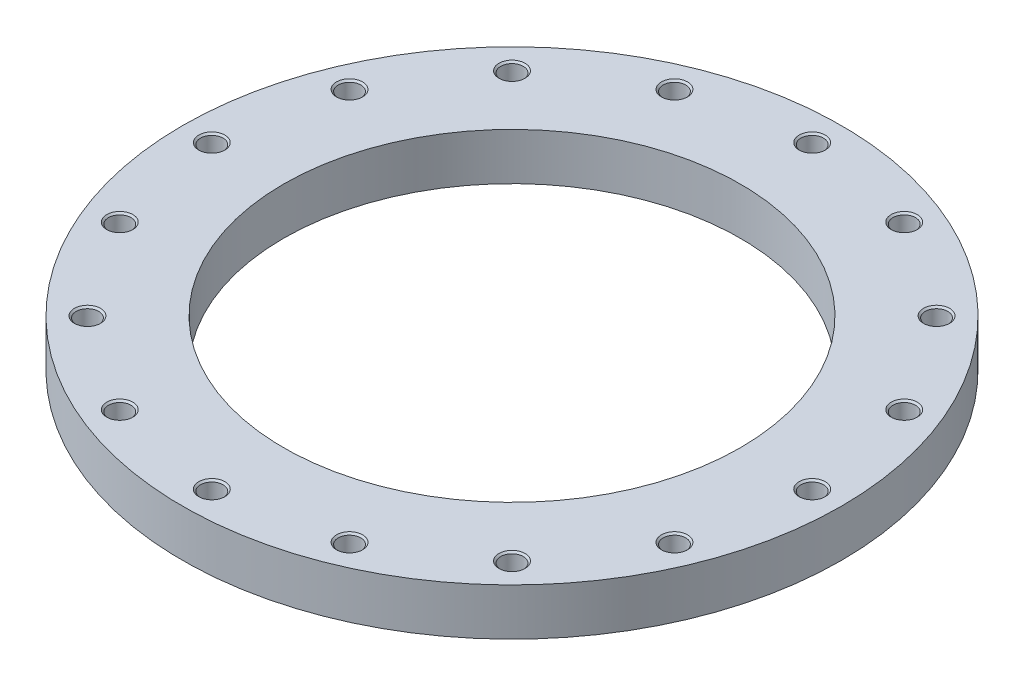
ISO-10303-21;
HEADER;
FILE_DESCRIPTION(('STEP AP214'),'2;1');
FILE_NAME('part.step','',(''),(''),'','','');
FILE_SCHEMA(('AUTOMOTIVE_DESIGN { 1 0 10303 214 1 1 1 1 }'));
ENDSEC;
DATA;
#1=APPLICATION_CONTEXT('core data for automotive mechanical design processes');
#2=APPLICATION_PROTOCOL_DEFINITION('international standard','automotive_design',2000,#1);
#3=PRODUCT_CONTEXT('',#1,'mechanical');
#4=PRODUCT('Part','Part','',(#3));
#5=PRODUCT_RELATED_PRODUCT_CATEGORY('part','',(#4));
#6=PRODUCT_DEFINITION_FORMATION('','',#4);
#7=PRODUCT_DEFINITION_CONTEXT('part definition',#1,'design');
#8=PRODUCT_DEFINITION('design','',#6,#7);
#9=PRODUCT_DEFINITION_SHAPE('','',#8);
#10=(LENGTH_UNIT() NAMED_UNIT(*) SI_UNIT(.MILLI.,.METRE.));
#11=(NAMED_UNIT(*) PLANE_ANGLE_UNIT() SI_UNIT($,.RADIAN.));
#12=(NAMED_UNIT(*) SI_UNIT($,.STERADIAN.) SOLID_ANGLE_UNIT());
#13=UNCERTAINTY_MEASURE_WITH_UNIT(LENGTH_MEASURE(1.E-05),#10,'distance_accuracy_value','');
#14=(GEOMETRIC_REPRESENTATION_CONTEXT(3) GLOBAL_UNCERTAINTY_ASSIGNED_CONTEXT((#13)) GLOBAL_UNIT_ASSIGNED_CONTEXT((#10,
#11,#12)) REPRESENTATION_CONTEXT('',''));
#15=CARTESIAN_POINT('',(0.,0.,0.));
#16=DIRECTION('',(0.,0.,1.));
#17=DIRECTION('',(1.,0.,0.));
#18=AXIS2_PLACEMENT_3D('',#15,#16,#17);
#19=CARTESIAN_POINT('',(0.,18.,0.));
#20=DIRECTION('',(0.,-1.,0.));
#21=DIRECTION('',(1.,0.,0.));
#22=AXIS2_PLACEMENT_3D('',#19,#20,#21);
#23=CYLINDRICAL_SURFACE('',#22,252.5);
#24=CARTESIAN_POINT('',(0.,0.,0.));
#25=DIRECTION('',(0.,1.,0.));
#26=DIRECTION('',(1.,0.,0.));
#27=AXIS2_PLACEMENT_3D('',#24,#25,#26);
#28=CIRCLE('',#27,252.5);
#29=CARTESIAN_POINT('',(252.5,0.,0.));
#30=VERTEX_POINT('',#29);
#31=EDGE_CURVE('E9',#30,#30,#28,.T.);
#32=ORIENTED_EDGE('',*,*,#31,.T.);
#33=EDGE_LOOP('',(#32));
#34=FACE_BOUND('',#33,.T.);
#35=CARTESIAN_POINT('',(0.,36.,0.));
#36=DIRECTION('',(0.,1.,0.));
#37=DIRECTION('',(1.,0.,0.));
#38=AXIS2_PLACEMENT_3D('',#35,#36,#37);
#39=CIRCLE('',#38,252.5);
#40=CARTESIAN_POINT('',(252.5,36.,0.));
#41=VERTEX_POINT('',#40);
#42=EDGE_CURVE('E430',#41,#41,#39,.T.);
#43=ORIENTED_EDGE('',*,*,#42,.F.);
#44=EDGE_LOOP('',(#43));
#45=FACE_BOUND('',#44,.T.);
#46=ADVANCED_FACE('F15',(#34,#45),#23,.T.);
#47=CARTESIAN_POINT('',(213.75,0.,0.));
#48=DIRECTION('',(0.,-1.,0.));
#49=DIRECTION('',(-1.,0.,0.));
#50=AXIS2_PLACEMENT_3D('',#47,#48,#49);
#51=PLANE('',#50);
#52=CARTESIAN_POINT('',(0.,0.,0.));
#53=DIRECTION('',(0.,1.,0.));
#54=DIRECTION('',(1.,0.,0.));
#55=AXIS2_PLACEMENT_3D('',#52,#53,#54);
#56=CIRCLE('',#55,175.);
#57=CARTESIAN_POINT('',(175.,0.,0.));
#58=VERTEX_POINT('',#57);
#59=EDGE_CURVE('E22',#58,#58,#56,.T.);
#60=ORIENTED_EDGE('',*,*,#59,.T.);
#61=EDGE_LOOP('',(#60));
#62=FACE_BOUND('',#61,.T.);
#63=ORIENTED_EDGE('',*,*,#31,.F.);
#64=EDGE_LOOP('',(#63));
#65=FACE_BOUND('',#64,.T.);
#66=ADVANCED_FACE('F478',(#62,#65),#51,.T.);
#67=CARTESIAN_POINT('',(0.,18.,0.));
#68=DIRECTION('',(0.,-1.,0.));
#69=DIRECTION('',(1.,0.,0.));
#70=AXIS2_PLACEMENT_3D('',#67,#68,#69);
#71=CYLINDRICAL_SURFACE('',#70,175.);
#72=CARTESIAN_POINT('',(0.,36.,0.));
#73=DIRECTION('',(0.,1.,0.));
#74=DIRECTION('',(1.,0.,0.));
#75=AXIS2_PLACEMENT_3D('',#72,#73,#74);
#76=CIRCLE('',#75,175.);
#77=CARTESIAN_POINT('',(175.,36.,0.));
#78=VERTEX_POINT('',#77);
#79=EDGE_CURVE('E379',#78,#78,#76,.T.);
#80=ORIENTED_EDGE('',*,*,#79,.T.);
#81=EDGE_LOOP('',(#80));
#82=FACE_BOUND('',#81,.T.);
#83=ORIENTED_EDGE('',*,*,#59,.F.);
#84=EDGE_LOOP('',(#83));
#85=FACE_BOUND('',#84,.T.);
#86=ADVANCED_FACE('F483',(#82,#85),#71,.F.);
#87=CARTESIAN_POINT('',(213.75,36.,0.));
#88=DIRECTION('',(0.,1.,0.));
#89=DIRECTION('',(1.,0.,0.));
#90=AXIS2_PLACEMENT_3D('',#87,#88,#89);
#91=PLANE('',#90);
#92=ORIENTED_EDGE('',*,*,#42,.T.);
#93=EDGE_LOOP('',(#92));
#94=FACE_BOUND('',#93,.T.);
#95=ORIENTED_EDGE('',*,*,#79,.F.);
#96=EDGE_LOOP('',(#95));
#97=FACE_BOUND('',#96,.T.);
#98=CARTESIAN_POINT('',(230.,36.,0.));
#99=DIRECTION('',(0.,-1.,0.));
#100=DIRECTION('',(1.,0.,0.));
#101=AXIS2_PLACEMENT_3D('',#98,#99,#100);
#102=CIRCLE('',#101,10.);
#103=CARTESIAN_POINT('',(240.,36.,0.));
#104=VERTEX_POINT('',#103);
#105=EDGE_CURVE('E470',#104,#104,#102,.T.);
#106=ORIENTED_EDGE('',*,*,#105,.T.);
#107=EDGE_LOOP('',(#106));
#108=FACE_BOUND('',#107,.T.);
#109=CARTESIAN_POINT('',(212.492292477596,36.,-88.0171894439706));
#110=DIRECTION('',(0.,-1.,0.));
#111=DIRECTION('',(0.923879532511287,0.,-0.38268343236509));
#112=AXIS2_PLACEMENT_3D('',#109,#110,#111);
#113=CIRCLE('',#112,10.);
#114=CARTESIAN_POINT('',(221.731087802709,36.,-91.8440237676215));
#115=VERTEX_POINT('',#114);
#116=EDGE_CURVE('E440',#115,#115,#113,.T.);
#117=ORIENTED_EDGE('',*,*,#116,.T.);
#118=EDGE_LOOP('',(#117));
#119=FACE_BOUND('',#118,.T.);
#120=CARTESIAN_POINT('',(162.634559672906,36.,-162.634559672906));
#121=DIRECTION('',(0.,-1.,0.));
#122=DIRECTION('',(0.707106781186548,0.,-0.707106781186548));
#123=AXIS2_PLACEMENT_3D('',#120,#121,#122);
#124=CIRCLE('',#123,10.);
#125=CARTESIAN_POINT('',(169.705627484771,36.,-169.705627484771));
#126=VERTEX_POINT('',#125);
#127=EDGE_CURVE('E458',#126,#126,#124,.T.);
#128=ORIENTED_EDGE('',*,*,#127,.T.);
#129=EDGE_LOOP('',(#128));
#130=FACE_BOUND('',#129,.T.);
#131=CARTESIAN_POINT('',(88.0171894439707,36.,-212.492292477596));
#132=DIRECTION('',(0.,-1.,0.));
#133=DIRECTION('',(0.38268343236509,0.,-0.923879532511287));
#134=AXIS2_PLACEMENT_3D('',#131,#132,#133);
#135=CIRCLE('',#134,10.);
#136=CARTESIAN_POINT('',(91.8440237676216,36.,-221.731087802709));
#137=VERTEX_POINT('',#136);
#138=EDGE_CURVE('E415',#137,#137,#135,.T.);
#139=ORIENTED_EDGE('',*,*,#138,.T.);
#140=EDGE_LOOP('',(#139));
#141=FACE_BOUND('',#140,.T.);
#142=CARTESIAN_POINT('',(0.,36.,-230.));
#143=DIRECTION('',(0.,-1.,0.));
#144=DIRECTION('',(0.,0.,-1.));
#145=AXIS2_PLACEMENT_3D('',#142,#143,#144);
#146=CIRCLE('',#145,10.);
#147=CARTESIAN_POINT('',(0.,36.,-240.));
#148=VERTEX_POINT('',#147);
#149=EDGE_CURVE('E443',#148,#148,#146,.T.);
#150=ORIENTED_EDGE('',*,*,#149,.T.);
#151=EDGE_LOOP('',(#150));
#152=FACE_BOUND('',#151,.T.);
#153=CARTESIAN_POINT('',(-88.0171894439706,36.,-212.492292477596));
#154=DIRECTION('',(0.,-1.,0.));
#155=DIRECTION('',(-0.38268343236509,0.,-0.923879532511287));
#156=AXIS2_PLACEMENT_3D('',#153,#154,#155);
#157=CIRCLE('',#156,10.);
#158=CARTESIAN_POINT('',(-91.8440237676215,36.,-221.731087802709));
#159=VERTEX_POINT('',#158);
#160=EDGE_CURVE('E422',#159,#159,#157,.T.);
#161=ORIENTED_EDGE('',*,*,#160,.T.);
#162=EDGE_LOOP('',(#161));
#163=FACE_BOUND('',#162,.T.);
#164=CARTESIAN_POINT('',(-162.634559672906,36.,-162.634559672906));
#165=DIRECTION('',(0.,-1.,0.));
#166=DIRECTION('',(-0.707106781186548,0.,-0.707106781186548));
#167=AXIS2_PLACEMENT_3D('',#164,#165,#166);
#168=CIRCLE('',#167,10.);
#169=CARTESIAN_POINT('',(-169.705627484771,36.,-169.705627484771));
#170=VERTEX_POINT('',#169);
#171=EDGE_CURVE('E411',#170,#170,#168,.T.);
#172=ORIENTED_EDGE('',*,*,#171,.T.);
#173=EDGE_LOOP('',(#172));
#174=FACE_BOUND('',#173,.T.);
#175=CARTESIAN_POINT('',(-212.492292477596,36.,-88.0171894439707));
#176=DIRECTION('',(0.,-1.,0.));
#177=DIRECTION('',(-0.923879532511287,0.,-0.38268343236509));
#178=AXIS2_PLACEMENT_3D('',#175,#176,#177);
#179=CIRCLE('',#178,10.);
#180=CARTESIAN_POINT('',(-221.731087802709,36.,-91.8440237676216));
#181=VERTEX_POINT('',#180);
#182=EDGE_CURVE('E400',#181,#181,#179,.T.);
#183=ORIENTED_EDGE('',*,*,#182,.T.);
#184=EDGE_LOOP('',(#183));
#185=FACE_BOUND('',#184,.T.);
#186=CARTESIAN_POINT('',(-230.,36.,0.));
#187=DIRECTION('',(0.,-1.,0.));
#188=DIRECTION('',(-1.,0.,0.));
#189=AXIS2_PLACEMENT_3D('',#186,#187,#188);
#190=CIRCLE('',#189,10.);
#191=CARTESIAN_POINT('',(-240.,36.,0.));
#192=VERTEX_POINT('',#191);
#193=EDGE_CURVE('E389',#192,#192,#190,.T.);
#194=ORIENTED_EDGE('',*,*,#193,.T.);
#195=EDGE_LOOP('',(#194));
#196=FACE_BOUND('',#195,.T.);
#197=CARTESIAN_POINT('',(-212.492292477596,36.,88.0171894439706));
#198=DIRECTION('',(0.,-1.,0.));
#199=DIRECTION('',(-0.923879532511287,0.,0.38268343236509));
#200=AXIS2_PLACEMENT_3D('',#197,#198,#199);
#201=CIRCLE('',#200,10.);
#202=CARTESIAN_POINT('',(-221.731087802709,36.,91.8440237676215));
#203=VERTEX_POINT('',#202);
#204=EDGE_CURVE('E905',#203,#203,#201,.T.);
#205=ORIENTED_EDGE('',*,*,#204,.T.);
#206=EDGE_LOOP('',(#205));
#207=FACE_BOUND('',#206,.T.);
#208=CARTESIAN_POINT('',(-162.634559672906,36.,162.634559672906));
#209=DIRECTION('',(0.,-1.,0.));
#210=DIRECTION('',(-0.707106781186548,0.,0.707106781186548));
#211=AXIS2_PLACEMENT_3D('',#208,#209,#210);
#212=CIRCLE('',#211,10.);
#213=CARTESIAN_POINT('',(-169.705627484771,36.,169.705627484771));
#214=VERTEX_POINT('',#213);
#215=EDGE_CURVE('E961',#214,#214,#212,.T.);
#216=ORIENTED_EDGE('',*,*,#215,.T.);
#217=EDGE_LOOP('',(#216));
#218=FACE_BOUND('',#217,.T.);
#219=CARTESIAN_POINT('',(-88.0171894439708,36.,212.492292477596));
#220=DIRECTION('',(0.,-1.,0.));
#221=DIRECTION('',(-0.382683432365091,0.,0.923879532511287));
#222=AXIS2_PLACEMENT_3D('',#219,#220,#221);
#223=CIRCLE('',#222,10.);
#224=CARTESIAN_POINT('',(-91.8440237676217,36.,221.731087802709));
#225=VERTEX_POINT('',#224);
#226=EDGE_CURVE('E946',#225,#225,#223,.T.);
#227=ORIENTED_EDGE('',*,*,#226,.T.);
#228=EDGE_LOOP('',(#227));
#229=FACE_BOUND('',#228,.T.);
#230=CARTESIAN_POINT('',(0.,36.,230.));
#231=DIRECTION('',(0.,-1.,0.));
#232=DIRECTION('',(0.,0.,1.));
#233=AXIS2_PLACEMENT_3D('',#230,#231,#232);
#234=CIRCLE('',#233,10.);
#235=CARTESIAN_POINT('',(0.,36.,240.));
#236=VERTEX_POINT('',#235);
#237=EDGE_CURVE('E932',#236,#236,#234,.T.);
#238=ORIENTED_EDGE('',*,*,#237,.T.);
#239=EDGE_LOOP('',(#238));
#240=FACE_BOUND('',#239,.T.);
#241=CARTESIAN_POINT('',(88.0171894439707,36.,212.492292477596));
#242=DIRECTION('',(0.,-1.,0.));
#243=DIRECTION('',(0.38268343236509,0.,0.923879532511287));
#244=AXIS2_PLACEMENT_3D('',#241,#242,#243);
#245=CIRCLE('',#244,10.);
#246=CARTESIAN_POINT('',(91.8440237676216,36.,221.731087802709));
#247=VERTEX_POINT('',#246);
#248=EDGE_CURVE('E896',#247,#247,#245,.T.);
#249=ORIENTED_EDGE('',*,*,#248,.T.);
#250=EDGE_LOOP('',(#249));
#251=FACE_BOUND('',#250,.T.);
#252=CARTESIAN_POINT('',(162.634559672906,36.,162.634559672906));
#253=DIRECTION('',(0.,-1.,0.));
#254=DIRECTION('',(0.707106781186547,0.,0.707106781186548));
#255=AXIS2_PLACEMENT_3D('',#252,#253,#254);
#256=CIRCLE('',#255,10.);
#257=CARTESIAN_POINT('',(169.705627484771,36.,169.705627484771));
#258=VERTEX_POINT('',#257);
#259=EDGE_CURVE('E883',#258,#258,#256,.T.);
#260=ORIENTED_EDGE('',*,*,#259,.T.);
#261=EDGE_LOOP('',(#260));
#262=FACE_BOUND('',#261,.T.);
#263=CARTESIAN_POINT('',(212.492292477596,36.,88.0171894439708));
#264=DIRECTION('',(0.,-1.,0.));
#265=DIRECTION('',(0.923879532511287,0.,0.382683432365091));
#266=AXIS2_PLACEMENT_3D('',#263,#264,#265);
#267=CIRCLE('',#266,10.);
#268=CARTESIAN_POINT('',(221.731087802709,36.,91.8440237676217));
#269=VERTEX_POINT('',#268);
#270=EDGE_CURVE('E891',#269,#269,#267,.T.);
#271=ORIENTED_EDGE('',*,*,#270,.T.);
#272=EDGE_LOOP('',(#271));
#273=FACE_BOUND('',#272,.T.);
#274=ADVANCED_FACE('F474',(#94,#97,#108,#119,#130,#141,#152,#163,#174,#185,#196,#207,#218,#229,
#240,#251,#262,#273),#91,.T.);
#275=CARTESIAN_POINT('',(230.,5.50386219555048,0.));
#276=DIRECTION('',(0.,1.,0.));
#277=DIRECTION('',(1.,0.,0.));
#278=AXIS2_PLACEMENT_3D('',#275,#276,#277);
#279=CONICAL_SURFACE('',#278,4.3234375,1.0471975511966);
#280=CARTESIAN_POINT('',(230.,8.,0.));
#281=DIRECTION('',(0.,-1.,0.));
#282=DIRECTION('',(1.,0.,0.));
#283=AXIS2_PLACEMENT_3D('',#280,#281,#282);
#284=CIRCLE('',#283,8.646875);
#285=CARTESIAN_POINT('',(238.646875,8.,0.));
#286=VERTEX_POINT('',#285);
#287=EDGE_CURVE('E376',#286,#286,#284,.T.);
#288=ORIENTED_EDGE('',*,*,#287,.F.);
#289=EDGE_LOOP('',(#288));
#290=FACE_BOUND('',#289,.T.);
#291=CARTESIAN_POINT('',(230.,3.00772439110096,0.));
#292=VERTEX_POINT('',#291);
#293=VERTEX_LOOP('',#292);
#294=FACE_BOUND('',#293,.T.);
#295=ADVANCED_FACE('F493',(#290,#294),#279,.F.);
#296=CARTESIAN_POINT('',(230.,11.3234375,0.));
#297=DIRECTION('',(0.,1.,0.));
#298=DIRECTION('',(1.,0.,0.));
#299=AXIS2_PLACEMENT_3D('',#296,#297,#298);
#300=CYLINDRICAL_SURFACE('',#299,8.646875);
#301=CARTESIAN_POINT('',(230.,14.646875,0.));
#302=DIRECTION('',(0.,-1.,0.));
#303=DIRECTION('',(1.,0.,0.));
#304=AXIS2_PLACEMENT_3D('',#301,#302,#303);
#305=CIRCLE('',#304,8.646875);
#306=CARTESIAN_POINT('',(238.646875,14.646875,0.));
#307=VERTEX_POINT('',#306);
#308=EDGE_CURVE('E373',#307,#307,#305,.T.);
#309=ORIENTED_EDGE('',*,*,#308,.F.);
#310=EDGE_LOOP('',(#309));
#311=FACE_BOUND('',#310,.T.);
#312=ORIENTED_EDGE('',*,*,#287,.T.);
#313=EDGE_LOOP('',(#312));
#314=FACE_BOUND('',#313,.T.);
#315=ADVANCED_FACE('F497',(#311,#314),#300,.F.);
#316=CARTESIAN_POINT('',(230.,15.3234375,0.));
#317=DIRECTION('',(0.,1.,0.));
#318=DIRECTION('',(1.,0.,0.));
#319=AXIS2_PLACEMENT_3D('',#316,#317,#318);
#320=CONICAL_SURFACE('',#319,9.3234375,0.785398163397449);
#321=CARTESIAN_POINT('',(230.,16.,0.));
#322=DIRECTION('',(0.,-1.,0.));
#323=DIRECTION('',(1.,0.,0.));
#324=AXIS2_PLACEMENT_3D('',#321,#322,#323);
#325=CIRCLE('',#324,10.);
#326=CARTESIAN_POINT('',(240.,16.,0.));
#327=VERTEX_POINT('',#326);
#328=EDGE_CURVE('E377',#327,#327,#325,.T.);
#329=ORIENTED_EDGE('',*,*,#328,.F.);
#330=EDGE_LOOP('',(#329));
#331=FACE_BOUND('',#330,.T.);
#332=ORIENTED_EDGE('',*,*,#308,.T.);
#333=EDGE_LOOP('',(#332));
#334=FACE_BOUND('',#333,.T.);
#335=ADVANCED_FACE('F374',(#331,#334),#320,.F.);
#336=CARTESIAN_POINT('',(239.3234375,16.,0.));
#337=DIRECTION('',(0.,1.,0.));
#338=DIRECTION('',(-1.,0.,0.));
#339=AXIS2_PLACEMENT_3D('',#336,#337,#338);
#340=PLANE('',#339);
#341=CARTESIAN_POINT('',(230.,16.,0.));
#342=DIRECTION('',(0.,-1.,0.));
#343=DIRECTION('',(1.,0.,0.));
#344=AXIS2_PLACEMENT_3D('',#341,#342,#343);
#345=CIRCLE('',#344,8.646875);
#346=CARTESIAN_POINT('',(238.646875,16.,0.));
#347=VERTEX_POINT('',#346);
#348=EDGE_CURVE('E381',#347,#347,#345,.T.);
#349=ORIENTED_EDGE('',*,*,#348,.F.);
#350=EDGE_LOOP('',(#349));
#351=FACE_BOUND('',#350,.T.);
#352=ORIENTED_EDGE('',*,*,#328,.T.);
#353=EDGE_LOOP('',(#352));
#354=FACE_BOUND('',#353,.T.);
#355=ADVANCED_FACE('F496',(#351,#354),#340,.F.);
#356=CARTESIAN_POINT('',(230.,25.3234375,0.));
#357=DIRECTION('',(0.,1.,0.));
#358=DIRECTION('',(1.,0.,0.));
#359=AXIS2_PLACEMENT_3D('',#356,#357,#358);
#360=CYLINDRICAL_SURFACE('',#359,8.646875);
#361=CARTESIAN_POINT('',(230.,34.646875,0.));
#362=DIRECTION('',(0.,-1.,0.));
#363=DIRECTION('',(1.,0.,0.));
#364=AXIS2_PLACEMENT_3D('',#361,#362,#363);
#365=CIRCLE('',#364,8.646875);
#366=CARTESIAN_POINT('',(238.646875,34.646875,0.));
#367=VERTEX_POINT('',#366);
#368=EDGE_CURVE('E468',#367,#367,#365,.T.);
#369=ORIENTED_EDGE('',*,*,#368,.F.);
#370=EDGE_LOOP('',(#369));
#371=FACE_BOUND('',#370,.T.);
#372=ORIENTED_EDGE('',*,*,#348,.T.);
#373=EDGE_LOOP('',(#372));
#374=FACE_BOUND('',#373,.T.);
#375=ADVANCED_FACE('F501',(#371,#374),#360,.F.);
#376=CARTESIAN_POINT('',(230.,35.3234375,0.));
#377=DIRECTION('',(0.,1.,0.));
#378=DIRECTION('',(1.,0.,0.));
#379=AXIS2_PLACEMENT_3D('',#376,#377,#378);
#380=CONICAL_SURFACE('',#379,9.3234375,0.785398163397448);
#381=ORIENTED_EDGE('',*,*,#105,.F.);
#382=EDGE_LOOP('',(#381));
#383=FACE_BOUND('',#382,.T.);
#384=ORIENTED_EDGE('',*,*,#368,.T.);
#385=EDGE_LOOP('',(#384));
#386=FACE_BOUND('',#385,.T.);
#387=ADVANCED_FACE('F505',(#383,#386),#380,.F.);
#388=CARTESIAN_POINT('',(212.492292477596,5.50386219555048,-88.0171894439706));
#389=DIRECTION('',(0.,1.,0.));
#390=DIRECTION('',(0.923879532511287,0.,-0.38268343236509));
#391=AXIS2_PLACEMENT_3D('',#388,#389,#390);
#392=CONICAL_SURFACE('',#391,4.3234375,1.0471975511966);
#393=CARTESIAN_POINT('',(212.492292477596,8.,-88.0171894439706));
#394=DIRECTION('',(0.,-1.,0.));
#395=DIRECTION('',(0.923879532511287,0.,-0.38268343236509));
#396=AXIS2_PLACEMENT_3D('',#393,#394,#395);
#397=CIRCLE('',#396,8.646875);
#398=CARTESIAN_POINT('',(220.480963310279,8.,-91.3262052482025));
#399=VERTEX_POINT('',#398);
#400=EDGE_CURVE('E466',#399,#399,#397,.T.);
#401=ORIENTED_EDGE('',*,*,#400,.F.);
#402=EDGE_LOOP('',(#401));
#403=FACE_BOUND('',#402,.T.);
#404=CARTESIAN_POINT('',(212.492292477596,3.00772439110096,-88.0171894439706));
#405=VERTEX_POINT('',#404);
#406=VERTEX_LOOP('',#405);
#407=FACE_BOUND('',#406,.T.);
#408=ADVANCED_FACE('F509',(#403,#407),#392,.F.);
#409=CARTESIAN_POINT('',(212.492292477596,11.3234375,-88.0171894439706));
#410=DIRECTION('',(0.,1.,0.));
#411=DIRECTION('',(0.923879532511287,0.,-0.38268343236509));
#412=AXIS2_PLACEMENT_3D('',#409,#410,#411);
#413=CYLINDRICAL_SURFACE('',#412,8.646875);
#414=CARTESIAN_POINT('',(212.492292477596,14.646875,-88.0171894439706));
#415=DIRECTION('',(0.,-1.,0.));
#416=DIRECTION('',(0.923879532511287,0.,-0.38268343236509));
#417=AXIS2_PLACEMENT_3D('',#414,#415,#416);
#418=CIRCLE('',#417,8.646875);
#419=CARTESIAN_POINT('',(220.480963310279,14.646875,-91.3262052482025));
#420=VERTEX_POINT('',#419);
#421=EDGE_CURVE('E464',#420,#420,#418,.T.);
#422=ORIENTED_EDGE('',*,*,#421,.F.);
#423=EDGE_LOOP('',(#422));
#424=FACE_BOUND('',#423,.T.);
#425=ORIENTED_EDGE('',*,*,#400,.T.);
#426=EDGE_LOOP('',(#425));
#427=FACE_BOUND('',#426,.T.);
#428=ADVANCED_FACE('F513',(#424,#427),#413,.F.);
#429=CARTESIAN_POINT('',(212.492292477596,15.3234375,-88.0171894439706));
#430=DIRECTION('',(0.,1.,0.));
#431=DIRECTION('',(0.923879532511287,0.,-0.38268343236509));
#432=AXIS2_PLACEMENT_3D('',#429,#430,#431);
#433=CONICAL_SURFACE('',#432,9.3234375,0.785398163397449);
#434=CARTESIAN_POINT('',(212.492292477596,16.,-88.0171894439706));
#435=DIRECTION('',(0.,-1.,0.));
#436=DIRECTION('',(0.923879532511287,0.,-0.38268343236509));
#437=AXIS2_PLACEMENT_3D('',#434,#435,#436);
#438=CIRCLE('',#437,10.);
#439=CARTESIAN_POINT('',(221.731087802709,16.,-91.8440237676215));
#440=VERTEX_POINT('',#439);
#441=EDGE_CURVE('E463',#440,#440,#438,.T.);
#442=ORIENTED_EDGE('',*,*,#441,.F.);
#443=EDGE_LOOP('',(#442));
#444=FACE_BOUND('',#443,.T.);
#445=ORIENTED_EDGE('',*,*,#421,.T.);
#446=EDGE_LOOP('',(#445));
#447=FACE_BOUND('',#446,.T.);
#448=ADVANCED_FACE('F517',(#444,#447),#433,.F.);
#449=CARTESIAN_POINT('',(221.106025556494,16.,-91.585114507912));
#450=DIRECTION('',(0.,1.,0.));
#451=DIRECTION('',(-0.923879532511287,0.,0.38268343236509));
#452=AXIS2_PLACEMENT_3D('',#449,#450,#451);
#453=PLANE('',#452);
#454=CARTESIAN_POINT('',(212.492292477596,16.,-88.0171894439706));
#455=DIRECTION('',(0.,-1.,0.));
#456=DIRECTION('',(0.923879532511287,0.,-0.38268343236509));
#457=AXIS2_PLACEMENT_3D('',#454,#455,#456);
#458=CIRCLE('',#457,8.646875);
#459=CARTESIAN_POINT('',(220.480963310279,16.,-91.3262052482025));
#460=VERTEX_POINT('',#459);
#461=EDGE_CURVE('E461',#460,#460,#458,.T.);
#462=ORIENTED_EDGE('',*,*,#461,.F.);
#463=EDGE_LOOP('',(#462));
#464=FACE_BOUND('',#463,.T.);
#465=ORIENTED_EDGE('',*,*,#441,.T.);
#466=EDGE_LOOP('',(#465));
#467=FACE_BOUND('',#466,.T.);
#468=ADVANCED_FACE('F697',(#464,#467),#453,.F.);
#469=CARTESIAN_POINT('',(212.492292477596,25.3234375,-88.0171894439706));
#470=DIRECTION('',(0.,1.,0.));
#471=DIRECTION('',(0.923879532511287,0.,-0.38268343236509));
#472=AXIS2_PLACEMENT_3D('',#469,#470,#471);
#473=CYLINDRICAL_SURFACE('',#472,8.646875);
#474=CARTESIAN_POINT('',(212.492292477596,34.646875,-88.0171894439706));
#475=DIRECTION('',(0.,-1.,0.));
#476=DIRECTION('',(0.923879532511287,0.,-0.38268343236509));
#477=AXIS2_PLACEMENT_3D('',#474,#475,#476);
#478=CIRCLE('',#477,8.646875);
#479=CARTESIAN_POINT('',(220.480963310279,34.646875,-91.3262052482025));
#480=VERTEX_POINT('',#479);
#481=EDGE_CURVE('E438',#480,#480,#478,.T.);
#482=ORIENTED_EDGE('',*,*,#481,.F.);
#483=EDGE_LOOP('',(#482));
#484=FACE_BOUND('',#483,.T.);
#485=ORIENTED_EDGE('',*,*,#461,.T.);
#486=EDGE_LOOP('',(#485));
#487=FACE_BOUND('',#486,.T.);
#488=ADVANCED_FACE('F523',(#484,#487),#473,.F.);
#489=CARTESIAN_POINT('',(212.492292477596,35.3234375,-88.0171894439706));
#490=DIRECTION('',(0.,1.,0.));
#491=DIRECTION('',(0.923879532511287,0.,-0.38268343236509));
#492=AXIS2_PLACEMENT_3D('',#489,#490,#491);
#493=CONICAL_SURFACE('',#492,9.3234375,0.785398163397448);
#494=ORIENTED_EDGE('',*,*,#116,.F.);
#495=EDGE_LOOP('',(#494));
#496=FACE_BOUND('',#495,.T.);
#497=ORIENTED_EDGE('',*,*,#481,.T.);
#498=EDGE_LOOP('',(#497));
#499=FACE_BOUND('',#498,.T.);
#500=ADVANCED_FACE('F519',(#496,#499),#493,.F.);
#501=CARTESIAN_POINT('',(162.634559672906,5.50386219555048,-162.634559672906));
#502=DIRECTION('',(0.,1.,0.));
#503=DIRECTION('',(0.707106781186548,0.,-0.707106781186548));
#504=AXIS2_PLACEMENT_3D('',#501,#502,#503);
#505=CONICAL_SURFACE('',#504,4.3234375,1.0471975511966);
#506=CARTESIAN_POINT('',(162.634559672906,8.,-162.634559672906));
#507=DIRECTION('',(0.,-1.,0.));
#508=DIRECTION('',(0.707106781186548,0.,-0.707106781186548));
#509=AXIS2_PLACEMENT_3D('',#506,#507,#508);
#510=CIRCLE('',#509,8.646875);
#511=CARTESIAN_POINT('',(168.748823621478,8.,-168.748823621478));
#512=VERTEX_POINT('',#511);
#513=EDGE_CURVE('E441',#512,#512,#510,.T.);
#514=ORIENTED_EDGE('',*,*,#513,.F.);
#515=EDGE_LOOP('',(#514));
#516=FACE_BOUND('',#515,.T.);
#517=CARTESIAN_POINT('',(162.634559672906,3.00772439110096,-162.634559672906));
#518=VERTEX_POINT('',#517);
#519=VERTEX_LOOP('',#518);
#520=FACE_BOUND('',#519,.T.);
#521=ADVANCED_FACE('F522',(#516,#520),#505,.F.);
#522=CARTESIAN_POINT('',(162.634559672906,11.3234375,-162.634559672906));
#523=DIRECTION('',(0.,1.,0.));
#524=DIRECTION('',(0.707106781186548,0.,-0.707106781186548));
#525=AXIS2_PLACEMENT_3D('',#522,#523,#524);
#526=CYLINDRICAL_SURFACE('',#525,8.646875);
#527=CARTESIAN_POINT('',(162.634559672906,14.646875,-162.634559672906));
#528=DIRECTION('',(0.,-1.,0.));
#529=DIRECTION('',(0.707106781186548,0.,-0.707106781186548));
#530=AXIS2_PLACEMENT_3D('',#527,#528,#529);
#531=CIRCLE('',#530,8.646875);
#532=CARTESIAN_POINT('',(168.748823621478,14.646875,-168.748823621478));
#533=VERTEX_POINT('',#532);
#534=EDGE_CURVE('E910',#533,#533,#531,.T.);
#535=ORIENTED_EDGE('',*,*,#534,.F.);
#536=EDGE_LOOP('',(#535));
#537=FACE_BOUND('',#536,.T.);
#538=ORIENTED_EDGE('',*,*,#513,.T.);
#539=EDGE_LOOP('',(#538));
#540=FACE_BOUND('',#539,.T.);
#541=ADVANCED_FACE('F527',(#537,#540),#526,.F.);
#542=CARTESIAN_POINT('',(162.634559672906,15.3234375,-162.634559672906));
#543=DIRECTION('',(0.,1.,0.));
#544=DIRECTION('',(0.707106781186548,0.,-0.707106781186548));
#545=AXIS2_PLACEMENT_3D('',#542,#543,#544);
#546=CONICAL_SURFACE('',#545,9.3234375,0.785398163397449);
#547=CARTESIAN_POINT('',(162.634559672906,16.,-162.634559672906));
#548=DIRECTION('',(0.,-1.,0.));
#549=DIRECTION('',(0.707106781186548,0.,-0.707106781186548));
#550=AXIS2_PLACEMENT_3D('',#547,#548,#549);
#551=CIRCLE('',#550,10.);
#552=CARTESIAN_POINT('',(169.705627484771,16.,-169.705627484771));
#553=VERTEX_POINT('',#552);
#554=EDGE_CURVE('E922',#553,#553,#551,.T.);
#555=ORIENTED_EDGE('',*,*,#554,.F.);
#556=EDGE_LOOP('',(#555));
#557=FACE_BOUND('',#556,.T.);
#558=ORIENTED_EDGE('',*,*,#534,.T.);
#559=EDGE_LOOP('',(#558));
#560=FACE_BOUND('',#559,.T.);
#561=ADVANCED_FACE('F577',(#557,#560),#546,.F.);
#562=CARTESIAN_POINT('',(169.227225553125,16.,-169.227225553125));
#563=DIRECTION('',(0.,1.,0.));
#564=DIRECTION('',(-0.707106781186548,0.,0.707106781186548));
#565=AXIS2_PLACEMENT_3D('',#562,#563,#564);
#566=PLANE('',#565);
#567=CARTESIAN_POINT('',(162.634559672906,16.,-162.634559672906));
#568=DIRECTION('',(0.,-1.,0.));
#569=DIRECTION('',(0.707106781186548,0.,-0.707106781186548));
#570=AXIS2_PLACEMENT_3D('',#567,#568,#569);
#571=CIRCLE('',#570,8.646875);
#572=CARTESIAN_POINT('',(168.748823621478,16.,-168.748823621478));
#573=VERTEX_POINT('',#572);
#574=EDGE_CURVE('E460',#573,#573,#571,.T.);
#575=ORIENTED_EDGE('',*,*,#574,.F.);
#576=EDGE_LOOP('',(#575));
#577=FACE_BOUND('',#576,.T.);
#578=ORIENTED_EDGE('',*,*,#554,.T.);
#579=EDGE_LOOP('',(#578));
#580=FACE_BOUND('',#579,.T.);
#581=ADVANCED_FACE('F580',(#577,#580),#566,.F.);
#582=CARTESIAN_POINT('',(162.634559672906,25.3234375,-162.634559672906));
#583=DIRECTION('',(0.,1.,0.));
#584=DIRECTION('',(0.707106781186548,0.,-0.707106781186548));
#585=AXIS2_PLACEMENT_3D('',#582,#583,#584);
#586=CYLINDRICAL_SURFACE('',#585,8.646875);
#587=CARTESIAN_POINT('',(162.634559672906,34.646875,-162.634559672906));
#588=DIRECTION('',(0.,-1.,0.));
#589=DIRECTION('',(0.707106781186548,0.,-0.707106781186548));
#590=AXIS2_PLACEMENT_3D('',#587,#588,#589);
#591=CIRCLE('',#590,8.646875);
#592=CARTESIAN_POINT('',(168.748823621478,34.646875,-168.748823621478));
#593=VERTEX_POINT('',#592);
#594=EDGE_CURVE('E456',#593,#593,#591,.T.);
#595=ORIENTED_EDGE('',*,*,#594,.F.);
#596=EDGE_LOOP('',(#595));
#597=FACE_BOUND('',#596,.T.);
#598=ORIENTED_EDGE('',*,*,#574,.T.);
#599=EDGE_LOOP('',(#598));
#600=FACE_BOUND('',#599,.T.);
#601=ADVANCED_FACE('F533',(#597,#600),#586,.F.);
#602=CARTESIAN_POINT('',(162.634559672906,35.3234375,-162.634559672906));
#603=DIRECTION('',(0.,1.,0.));
#604=DIRECTION('',(0.707106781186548,0.,-0.707106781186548));
#605=AXIS2_PLACEMENT_3D('',#602,#603,#604);
#606=CONICAL_SURFACE('',#605,9.3234375,0.785398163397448);
#607=ORIENTED_EDGE('',*,*,#127,.F.);
#608=EDGE_LOOP('',(#607));
#609=FACE_BOUND('',#608,.T.);
#610=ORIENTED_EDGE('',*,*,#594,.T.);
#611=EDGE_LOOP('',(#610));
#612=FACE_BOUND('',#611,.T.);
#613=ADVANCED_FACE('F529',(#609,#612),#606,.F.);
#614=CARTESIAN_POINT('',(88.0171894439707,5.50386219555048,-212.492292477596));
#615=DIRECTION('',(0.,1.,0.));
#616=DIRECTION('',(0.38268343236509,0.,-0.923879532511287));
#617=AXIS2_PLACEMENT_3D('',#614,#615,#616);
#618=CONICAL_SURFACE('',#617,4.3234375,1.0471975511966);
#619=CARTESIAN_POINT('',(88.0171894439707,8.,-212.492292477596));
#620=DIRECTION('',(0.,-1.,0.));
#621=DIRECTION('',(0.38268343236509,0.,-0.923879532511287));
#622=AXIS2_PLACEMENT_3D('',#619,#620,#621);
#623=CIRCLE('',#622,8.646875);
#624=CARTESIAN_POINT('',(91.3262052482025,8.,-220.480963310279));
#625=VERTEX_POINT('',#624);
#626=EDGE_CURVE('E435',#625,#625,#623,.T.);
#627=ORIENTED_EDGE('',*,*,#626,.F.);
#628=EDGE_LOOP('',(#627));
#629=FACE_BOUND('',#628,.T.);
#630=CARTESIAN_POINT('',(88.0171894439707,3.00772439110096,-212.492292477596));
#631=VERTEX_POINT('',#630);
#632=VERTEX_LOOP('',#631);
#633=FACE_BOUND('',#632,.T.);
#634=ADVANCED_FACE('F532',(#629,#633),#618,.F.);
#635=CARTESIAN_POINT('',(88.0171894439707,11.3234375,-212.492292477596));
#636=DIRECTION('',(0.,1.,0.));
#637=DIRECTION('',(0.38268343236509,0.,-0.923879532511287));
#638=AXIS2_PLACEMENT_3D('',#635,#636,#637);
#639=CYLINDRICAL_SURFACE('',#638,8.646875);
#640=CARTESIAN_POINT('',(88.0171894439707,14.646875,-212.492292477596));
#641=DIRECTION('',(0.,-1.,0.));
#642=DIRECTION('',(0.38268343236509,0.,-0.923879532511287));
#643=AXIS2_PLACEMENT_3D('',#640,#641,#642);
#644=CIRCLE('',#643,8.646875);
#645=CARTESIAN_POINT('',(91.3262052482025,14.646875,-220.480963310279));
#646=VERTEX_POINT('',#645);
#647=EDGE_CURVE('E433',#646,#646,#644,.T.);
#648=ORIENTED_EDGE('',*,*,#647,.F.);
#649=EDGE_LOOP('',(#648));
#650=FACE_BOUND('',#649,.T.);
#651=ORIENTED_EDGE('',*,*,#626,.T.);
#652=EDGE_LOOP('',(#651));
#653=FACE_BOUND('',#652,.T.);
#654=ADVANCED_FACE('F758',(#650,#653),#639,.F.);
#655=CARTESIAN_POINT('',(88.0171894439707,15.3234375,-212.492292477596));
#656=DIRECTION('',(0.,1.,0.));
#657=DIRECTION('',(0.38268343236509,0.,-0.923879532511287));
#658=AXIS2_PLACEMENT_3D('',#655,#656,#657);
#659=CONICAL_SURFACE('',#658,9.3234375,0.785398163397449);
#660=CARTESIAN_POINT('',(88.0171894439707,16.,-212.492292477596));
#661=DIRECTION('',(0.,-1.,0.));
#662=DIRECTION('',(0.38268343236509,0.,-0.923879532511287));
#663=AXIS2_PLACEMENT_3D('',#660,#661,#662);
#664=CIRCLE('',#663,10.);
#665=CARTESIAN_POINT('',(91.8440237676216,16.,-221.731087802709));
#666=VERTEX_POINT('',#665);
#667=EDGE_CURVE('E414',#666,#666,#664,.T.);
#668=ORIENTED_EDGE('',*,*,#667,.F.);
#669=EDGE_LOOP('',(#668));
#670=FACE_BOUND('',#669,.T.);
#671=ORIENTED_EDGE('',*,*,#647,.T.);
#672=EDGE_LOOP('',(#671));
#673=FACE_BOUND('',#672,.T.);
#674=ADVANCED_FACE('F539',(#670,#673),#659,.F.);
#675=CARTESIAN_POINT('',(91.5851145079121,16.,-221.106025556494));
#676=DIRECTION('',(0.,1.,0.));
#677=DIRECTION('',(-0.38268343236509,0.,0.923879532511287));
#678=AXIS2_PLACEMENT_3D('',#675,#676,#677);
#679=PLANE('',#678);
#680=CARTESIAN_POINT('',(88.0171894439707,16.,-212.492292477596));
#681=DIRECTION('',(0.,-1.,0.));
#682=DIRECTION('',(0.38268343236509,0.,-0.923879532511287));
#683=AXIS2_PLACEMENT_3D('',#680,#681,#682);
#684=CIRCLE('',#683,8.646875);
#685=CARTESIAN_POINT('',(91.3262052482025,16.,-220.480963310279));
#686=VERTEX_POINT('',#685);
#687=EDGE_CURVE('E412',#686,#686,#684,.T.);
#688=ORIENTED_EDGE('',*,*,#687,.F.);
#689=EDGE_LOOP('',(#688));
#690=FACE_BOUND('',#689,.T.);
#691=ORIENTED_EDGE('',*,*,#667,.T.);
#692=EDGE_LOOP('',(#691));
#693=FACE_BOUND('',#692,.T.);
#694=ADVANCED_FACE('F535',(#690,#693),#679,.F.);
#695=CARTESIAN_POINT('',(88.0171894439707,25.3234375,-212.492292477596));
#696=DIRECTION('',(0.,1.,0.));
#697=DIRECTION('',(0.38268343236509,0.,-0.923879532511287));
#698=AXIS2_PLACEMENT_3D('',#695,#696,#697);
#699=CYLINDRICAL_SURFACE('',#698,8.646875);
#700=CARTESIAN_POINT('',(88.0171894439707,34.646875,-212.492292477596));
#701=DIRECTION('',(0.,-1.,0.));
#702=DIRECTION('',(0.38268343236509,0.,-0.923879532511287));
#703=AXIS2_PLACEMENT_3D('',#700,#701,#702);
#704=CIRCLE('',#703,8.646875);
#705=CARTESIAN_POINT('',(91.3262052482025,34.646875,-220.480963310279));
#706=VERTEX_POINT('',#705);
#707=EDGE_CURVE('E452',#706,#706,#704,.T.);
#708=ORIENTED_EDGE('',*,*,#707,.F.);
#709=EDGE_LOOP('',(#708));
#710=FACE_BOUND('',#709,.T.);
#711=ORIENTED_EDGE('',*,*,#687,.T.);
#712=EDGE_LOOP('',(#711));
#713=FACE_BOUND('',#712,.T.);
#714=ADVANCED_FACE('F538',(#710,#713),#699,.F.);
#715=CARTESIAN_POINT('',(88.0171894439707,35.3234375,-212.492292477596));
#716=DIRECTION('',(0.,1.,0.));
#717=DIRECTION('',(0.38268343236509,0.,-0.923879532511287));
#718=AXIS2_PLACEMENT_3D('',#715,#716,#717);
#719=CONICAL_SURFACE('',#718,9.3234375,0.785398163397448);
#720=ORIENTED_EDGE('',*,*,#138,.F.);
#721=EDGE_LOOP('',(#720));
#722=FACE_BOUND('',#721,.T.);
#723=ORIENTED_EDGE('',*,*,#707,.T.);
#724=EDGE_LOOP('',(#723));
#725=FACE_BOUND('',#724,.T.);
#726=ADVANCED_FACE('F543',(#722,#725),#719,.F.);
#727=CARTESIAN_POINT('',(0.,5.50386219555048,-230.));
#728=DIRECTION('',(0.,1.,0.));
#729=DIRECTION('',(0.,0.,-1.));
#730=AXIS2_PLACEMENT_3D('',#727,#728,#729);
#731=CONICAL_SURFACE('',#730,4.3234375,1.0471975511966);
#732=CARTESIAN_POINT('',(0.,8.,-230.));
#733=DIRECTION('',(0.,-1.,0.));
#734=DIRECTION('',(0.,0.,-1.));
#735=AXIS2_PLACEMENT_3D('',#732,#733,#734);
#736=CIRCLE('',#735,8.646875);
#737=CARTESIAN_POINT('',(0.,8.,-238.646875));
#738=VERTEX_POINT('',#737);
#739=EDGE_CURVE('E450',#738,#738,#736,.T.);
#740=ORIENTED_EDGE('',*,*,#739,.F.);
#741=EDGE_LOOP('',(#740));
#742=FACE_BOUND('',#741,.T.);
#743=CARTESIAN_POINT('',(0.,3.00772439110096,-230.));
#744=VERTEX_POINT('',#743);
#745=VERTEX_LOOP('',#744);
#746=FACE_BOUND('',#745,.T.);
#747=ADVANCED_FACE('F547',(#742,#746),#731,.F.);
#748=CARTESIAN_POINT('',(0.,11.3234375,-230.));
#749=DIRECTION('',(0.,1.,0.));
#750=DIRECTION('',(0.,0.,-1.));
#751=AXIS2_PLACEMENT_3D('',#748,#749,#750);
#752=CYLINDRICAL_SURFACE('',#751,8.646875);
#753=CARTESIAN_POINT('',(0.,14.646875,-230.));
#754=DIRECTION('',(0.,-1.,0.));
#755=DIRECTION('',(0.,0.,-1.));
#756=AXIS2_PLACEMENT_3D('',#753,#754,#755);
#757=CIRCLE('',#756,8.646875);
#758=CARTESIAN_POINT('',(0.,14.646875,-238.646875));
#759=VERTEX_POINT('',#758);
#760=EDGE_CURVE('E448',#759,#759,#757,.T.);
#761=ORIENTED_EDGE('',*,*,#760,.F.);
#762=EDGE_LOOP('',(#761));
#763=FACE_BOUND('',#762,.T.);
#764=ORIENTED_EDGE('',*,*,#739,.T.);
#765=EDGE_LOOP('',(#764));
#766=FACE_BOUND('',#765,.T.);
#767=ADVANCED_FACE('F551',(#763,#766),#752,.F.);
#768=CARTESIAN_POINT('',(0.,15.3234375,-230.));
#769=DIRECTION('',(0.,1.,0.));
#770=DIRECTION('',(0.,0.,-1.));
#771=AXIS2_PLACEMENT_3D('',#768,#769,#770);
#772=CONICAL_SURFACE('',#771,9.3234375,0.785398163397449);
#773=CARTESIAN_POINT('',(0.,16.,-230.));
#774=DIRECTION('',(0.,-1.,0.));
#775=DIRECTION('',(0.,0.,-1.));
#776=AXIS2_PLACEMENT_3D('',#773,#774,#775);
#777=CIRCLE('',#776,10.);
#778=CARTESIAN_POINT('',(0.,16.,-240.));
#779=VERTEX_POINT('',#778);
#780=EDGE_CURVE('E446',#779,#779,#777,.T.);
#781=ORIENTED_EDGE('',*,*,#780,.F.);
#782=EDGE_LOOP('',(#781));
#783=FACE_BOUND('',#782,.T.);
#784=ORIENTED_EDGE('',*,*,#760,.T.);
#785=EDGE_LOOP('',(#784));
#786=FACE_BOUND('',#785,.T.);
#787=ADVANCED_FACE('F555',(#783,#786),#772,.F.);
#788=CARTESIAN_POINT('',(0.,16.,-239.3234375));
#789=DIRECTION('',(0.,1.,0.));
#790=DIRECTION('',(0.,0.,1.));
#791=AXIS2_PLACEMENT_3D('',#788,#789,#790);
#792=PLANE('',#791);
#793=CARTESIAN_POINT('',(0.,16.,-230.));
#794=DIRECTION('',(0.,-1.,0.));
#795=DIRECTION('',(0.,0.,-1.));
#796=AXIS2_PLACEMENT_3D('',#793,#794,#795);
#797=CIRCLE('',#796,8.646875);
#798=CARTESIAN_POINT('',(0.,16.,-238.646875));
#799=VERTEX_POINT('',#798);
#800=EDGE_CURVE('E444',#799,#799,#797,.T.);
#801=ORIENTED_EDGE('',*,*,#800,.F.);
#802=EDGE_LOOP('',(#801));
#803=FACE_BOUND('',#802,.T.);
#804=ORIENTED_EDGE('',*,*,#780,.T.);
#805=EDGE_LOOP('',(#804));
#806=FACE_BOUND('',#805,.T.);
#807=ADVANCED_FACE('F557',(#803,#806),#792,.F.);
#808=CARTESIAN_POINT('',(0.,25.3234375,-230.));
#809=DIRECTION('',(0.,1.,0.));
#810=DIRECTION('',(0.,0.,-1.));
#811=AXIS2_PLACEMENT_3D('',#808,#809,#810);
#812=CYLINDRICAL_SURFACE('',#811,8.646875);
#813=CARTESIAN_POINT('',(0.,34.646875,-230.));
#814=DIRECTION('',(0.,-1.,0.));
#815=DIRECTION('',(0.,0.,-1.));
#816=AXIS2_PLACEMENT_3D('',#813,#814,#815);
#817=CIRCLE('',#816,8.646875);
#818=CARTESIAN_POINT('',(0.,34.646875,-238.646875));
#819=VERTEX_POINT('',#818);
#820=EDGE_CURVE('E437',#819,#819,#817,.T.);
#821=ORIENTED_EDGE('',*,*,#820,.F.);
#822=EDGE_LOOP('',(#821));
#823=FACE_BOUND('',#822,.T.);
#824=ORIENTED_EDGE('',*,*,#800,.T.);
#825=EDGE_LOOP('',(#824));
#826=FACE_BOUND('',#825,.T.);
#827=ADVANCED_FACE('F560',(#823,#826),#812,.F.);
#828=CARTESIAN_POINT('',(0.,35.3234375,-230.));
#829=DIRECTION('',(0.,1.,0.));
#830=DIRECTION('',(0.,0.,-1.));
#831=AXIS2_PLACEMENT_3D('',#828,#829,#830);
#832=CONICAL_SURFACE('',#831,9.3234375,0.785398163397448);
#833=ORIENTED_EDGE('',*,*,#149,.F.);
#834=EDGE_LOOP('',(#833));
#835=FACE_BOUND('',#834,.T.);
#836=ORIENTED_EDGE('',*,*,#820,.T.);
#837=EDGE_LOOP('',(#836));
#838=FACE_BOUND('',#837,.T.);
#839=ADVANCED_FACE('F562',(#835,#838),#832,.F.);
#840=CARTESIAN_POINT('',(-88.0171894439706,5.50386219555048,-212.492292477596));
#841=DIRECTION('',(0.,1.,0.));
#842=DIRECTION('',(-0.38268343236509,0.,-0.923879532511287));
#843=AXIS2_PLACEMENT_3D('',#840,#841,#842);
#844=CONICAL_SURFACE('',#843,4.3234375,1.0471975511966);
#845=CARTESIAN_POINT('',(-88.0171894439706,8.,-212.492292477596));
#846=DIRECTION('',(0.,-1.,0.));
#847=DIRECTION('',(-0.38268343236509,0.,-0.923879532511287));
#848=AXIS2_PLACEMENT_3D('',#845,#846,#847);
#849=CIRCLE('',#848,8.646875);
#850=CARTESIAN_POINT('',(-91.3262052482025,8.,-220.480963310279));
#851=VERTEX_POINT('',#850);
#852=EDGE_CURVE('E432',#851,#851,#849,.T.);
#853=ORIENTED_EDGE('',*,*,#852,.F.);
#854=EDGE_LOOP('',(#853));
#855=FACE_BOUND('',#854,.T.);
#856=CARTESIAN_POINT('',(-88.0171894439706,3.00772439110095,-212.492292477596));
#857=VERTEX_POINT('',#856);
#858=VERTEX_LOOP('',#857);
#859=FACE_BOUND('',#858,.T.);
#860=ADVANCED_FACE('F565',(#855,#859),#844,.F.);
#861=CARTESIAN_POINT('',(-88.0171894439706,11.3234375,-212.492292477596));
#862=DIRECTION('',(0.,1.,0.));
#863=DIRECTION('',(-0.38268343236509,0.,-0.923879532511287));
#864=AXIS2_PLACEMENT_3D('',#861,#862,#863);
#865=CYLINDRICAL_SURFACE('',#864,8.646875);
#866=CARTESIAN_POINT('',(-88.0171894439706,14.646875,-212.492292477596));
#867=DIRECTION('',(0.,-1.,0.));
#868=DIRECTION('',(-0.38268343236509,0.,-0.923879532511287));
#869=AXIS2_PLACEMENT_3D('',#866,#867,#868);
#870=CIRCLE('',#869,8.646875);
#871=CARTESIAN_POINT('',(-91.3262052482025,14.646875,-220.480963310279));
#872=VERTEX_POINT('',#871);
#873=EDGE_CURVE('E428',#872,#872,#870,.T.);
#874=ORIENTED_EDGE('',*,*,#873,.F.);
#875=EDGE_LOOP('',(#874));
#876=FACE_BOUND('',#875,.T.);
#877=ORIENTED_EDGE('',*,*,#852,.T.);
#878=EDGE_LOOP('',(#877));
#879=FACE_BOUND('',#878,.T.);
#880=ADVANCED_FACE('F569',(#876,#879),#865,.F.);
#881=CARTESIAN_POINT('',(-88.0171894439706,15.3234375,-212.492292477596));
#882=DIRECTION('',(0.,1.,0.));
#883=DIRECTION('',(-0.38268343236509,0.,-0.923879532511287));
#884=AXIS2_PLACEMENT_3D('',#881,#882,#883);
#885=CONICAL_SURFACE('',#884,9.3234375,0.785398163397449);
#886=CARTESIAN_POINT('',(-88.0171894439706,16.,-212.492292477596));
#887=DIRECTION('',(0.,-1.,0.));
#888=DIRECTION('',(-0.38268343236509,0.,-0.923879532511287));
#889=AXIS2_PLACEMENT_3D('',#886,#887,#888);
#890=CIRCLE('',#889,10.);
#891=CARTESIAN_POINT('',(-91.8440237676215,16.,-221.731087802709));
#892=VERTEX_POINT('',#891);
#893=EDGE_CURVE('E426',#892,#892,#890,.T.);
#894=ORIENTED_EDGE('',*,*,#893,.F.);
#895=EDGE_LOOP('',(#894));
#896=FACE_BOUND('',#895,.T.);
#897=ORIENTED_EDGE('',*,*,#873,.T.);
#898=EDGE_LOOP('',(#897));
#899=FACE_BOUND('',#898,.T.);
#900=ADVANCED_FACE('F682',(#896,#899),#885,.F.);
#901=CARTESIAN_POINT('',(-91.585114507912,16.,-221.106025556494));
#902=DIRECTION('',(0.,1.,0.));
#903=DIRECTION('',(0.38268343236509,0.,0.923879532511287));
#904=AXIS2_PLACEMENT_3D('',#901,#902,#903);
#905=PLANE('',#904);
#906=CARTESIAN_POINT('',(-88.0171894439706,16.,-212.492292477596));
#907=DIRECTION('',(0.,-1.,0.));
#908=DIRECTION('',(-0.38268343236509,0.,-0.923879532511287));
#909=AXIS2_PLACEMENT_3D('',#906,#907,#908);
#910=CIRCLE('',#909,8.646875);
#911=CARTESIAN_POINT('',(-91.3262052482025,16.,-220.480963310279));
#912=VERTEX_POINT('',#911);
#913=EDGE_CURVE('E424',#912,#912,#910,.T.);
#914=ORIENTED_EDGE('',*,*,#913,.F.);
#915=EDGE_LOOP('',(#914));
#916=FACE_BOUND('',#915,.T.);
#917=ORIENTED_EDGE('',*,*,#893,.T.);
#918=EDGE_LOOP('',(#917));
#919=FACE_BOUND('',#918,.T.);
#920=ADVANCED_FACE('F575',(#916,#919),#905,.F.);
#921=CARTESIAN_POINT('',(-88.0171894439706,25.3234375,-212.492292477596));
#922=DIRECTION('',(0.,1.,0.));
#923=DIRECTION('',(-0.38268343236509,0.,-0.923879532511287));
#924=AXIS2_PLACEMENT_3D('',#921,#922,#923);
#925=CYLINDRICAL_SURFACE('',#924,8.646875);
#926=CARTESIAN_POINT('',(-88.0171894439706,34.646875,-212.492292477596));
#927=DIRECTION('',(0.,-1.,0.));
#928=DIRECTION('',(-0.38268343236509,0.,-0.923879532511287));
#929=AXIS2_PLACEMENT_3D('',#926,#927,#928);
#930=CIRCLE('',#929,8.646875);
#931=CARTESIAN_POINT('',(-91.3262052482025,34.646875,-220.480963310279));
#932=VERTEX_POINT('',#931);
#933=EDGE_CURVE('E425',#932,#932,#930,.T.);
#934=ORIENTED_EDGE('',*,*,#933,.F.);
#935=EDGE_LOOP('',(#934));
#936=FACE_BOUND('',#935,.T.);
#937=ORIENTED_EDGE('',*,*,#913,.T.);
#938=EDGE_LOOP('',(#937));
#939=FACE_BOUND('',#938,.T.);
#940=ADVANCED_FACE('F571',(#936,#939),#925,.F.);
#941=CARTESIAN_POINT('',(-88.0171894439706,35.3234375,-212.492292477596));
#942=DIRECTION('',(0.,1.,0.));
#943=DIRECTION('',(-0.38268343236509,0.,-0.923879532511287));
#944=AXIS2_PLACEMENT_3D('',#941,#942,#943);
#945=CONICAL_SURFACE('',#944,9.3234375,0.785398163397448);
#946=ORIENTED_EDGE('',*,*,#160,.F.);
#947=EDGE_LOOP('',(#946));
#948=FACE_BOUND('',#947,.T.);
#949=ORIENTED_EDGE('',*,*,#933,.T.);
#950=EDGE_LOOP('',(#949));
#951=FACE_BOUND('',#950,.T.);
#952=ADVANCED_FACE('F574',(#948,#951),#945,.F.);
#953=CARTESIAN_POINT('',(-162.634559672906,5.50386219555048,-162.634559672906));
#954=DIRECTION('',(0.,1.,0.));
#955=DIRECTION('',(-0.707106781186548,0.,-0.707106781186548));
#956=AXIS2_PLACEMENT_3D('',#953,#954,#955);
#957=CONICAL_SURFACE('',#956,4.3234375,1.0471975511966);
#958=CARTESIAN_POINT('',(-162.634559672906,8.,-162.634559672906));
#959=DIRECTION('',(0.,-1.,0.));
#960=DIRECTION('',(-0.707106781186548,0.,-0.707106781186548));
#961=AXIS2_PLACEMENT_3D('',#958,#959,#960);
#962=CIRCLE('',#961,8.646875);
#963=CARTESIAN_POINT('',(-168.748823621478,8.,-168.748823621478));
#964=VERTEX_POINT('',#963);
#965=EDGE_CURVE('E895',#964,#964,#962,.T.);
#966=ORIENTED_EDGE('',*,*,#965,.F.);
#967=EDGE_LOOP('',(#966));
#968=FACE_BOUND('',#967,.T.);
#969=CARTESIAN_POINT('',(-162.634559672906,3.00772439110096,-162.634559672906));
#970=VERTEX_POINT('',#969);
#971=VERTEX_LOOP('',#970);
#972=FACE_BOUND('',#971,.T.);
#973=ADVANCED_FACE('F584',(#968,#972),#957,.F.);
#974=CARTESIAN_POINT('',(-162.634559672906,11.3234375,-162.634559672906));
#975=DIRECTION('',(0.,1.,0.));
#976=DIRECTION('',(-0.707106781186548,0.,-0.707106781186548));
#977=AXIS2_PLACEMENT_3D('',#974,#975,#976);
#978=CYLINDRICAL_SURFACE('',#977,8.646875);
#979=CARTESIAN_POINT('',(-162.634559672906,14.646875,-162.634559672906));
#980=DIRECTION('',(0.,-1.,0.));
#981=DIRECTION('',(-0.707106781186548,0.,-0.707106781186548));
#982=AXIS2_PLACEMENT_3D('',#979,#980,#981);
#983=CIRCLE('',#982,8.646875);
#984=CARTESIAN_POINT('',(-168.748823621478,14.646875,-168.748823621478));
#985=VERTEX_POINT('',#984);
#986=EDGE_CURVE('E421',#985,#985,#983,.T.);
#987=ORIENTED_EDGE('',*,*,#986,.F.);
#988=EDGE_LOOP('',(#987));
#989=FACE_BOUND('',#988,.T.);
#990=ORIENTED_EDGE('',*,*,#965,.T.);
#991=EDGE_LOOP('',(#990));
#992=FACE_BOUND('',#991,.T.);
#993=ADVANCED_FACE('F588',(#989,#992),#978,.F.);
#994=CARTESIAN_POINT('',(-162.634559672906,15.3234375,-162.634559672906));
#995=DIRECTION('',(0.,1.,0.));
#996=DIRECTION('',(-0.707106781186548,0.,-0.707106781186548));
#997=AXIS2_PLACEMENT_3D('',#994,#995,#996);
#998=CONICAL_SURFACE('',#997,9.3234375,0.785398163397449);
#999=CARTESIAN_POINT('',(-162.634559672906,16.,-162.634559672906));
#1000=DIRECTION('',(0.,-1.,0.));
#1001=DIRECTION('',(-0.707106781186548,0.,-0.707106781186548));
#1002=AXIS2_PLACEMENT_3D('',#999,#1000,#1001);
#1003=CIRCLE('',#1002,10.);
#1004=CARTESIAN_POINT('',(-169.705627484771,16.,-169.705627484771));
#1005=VERTEX_POINT('',#1004);
#1006=EDGE_CURVE('E419',#1005,#1005,#1003,.T.);
#1007=ORIENTED_EDGE('',*,*,#1006,.F.);
#1008=EDGE_LOOP('',(#1007));
#1009=FACE_BOUND('',#1008,.T.);
#1010=ORIENTED_EDGE('',*,*,#986,.T.);
#1011=EDGE_LOOP('',(#1010));
#1012=FACE_BOUND('',#1011,.T.);
#1013=ADVANCED_FACE('F592',(#1009,#1012),#998,.F.);
#1014=CARTESIAN_POINT('',(-169.227225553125,16.,-169.227225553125));
#1015=DIRECTION('',(0.,1.,0.));
#1016=DIRECTION('',(0.707106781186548,0.,0.707106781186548));
#1017=AXIS2_PLACEMENT_3D('',#1014,#1015,#1016);
#1018=PLANE('',#1017);
#1019=CARTESIAN_POINT('',(-162.634559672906,16.,-162.634559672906));
#1020=DIRECTION('',(0.,-1.,0.));
#1021=DIRECTION('',(-0.707106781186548,0.,-0.707106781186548));
#1022=AXIS2_PLACEMENT_3D('',#1019,#1020,#1021);
#1023=CIRCLE('',#1022,8.646875);
#1024=CARTESIAN_POINT('',(-168.748823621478,16.,-168.748823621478));
#1025=VERTEX_POINT('',#1024);
#1026=EDGE_CURVE('E417',#1025,#1025,#1023,.T.);
#1027=ORIENTED_EDGE('',*,*,#1026,.F.);
#1028=EDGE_LOOP('',(#1027));
#1029=FACE_BOUND('',#1028,.T.);
#1030=ORIENTED_EDGE('',*,*,#1006,.T.);
#1031=EDGE_LOOP('',(#1030));
#1032=FACE_BOUND('',#1031,.T.);
#1033=ADVANCED_FACE('F594',(#1029,#1032),#1018,.F.);
#1034=CARTESIAN_POINT('',(-162.634559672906,25.3234375,-162.634559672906));
#1035=DIRECTION('',(0.,1.,0.));
#1036=DIRECTION('',(-0.707106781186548,0.,-0.707106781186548));
#1037=AXIS2_PLACEMENT_3D('',#1034,#1035,#1036);
#1038=CYLINDRICAL_SURFACE('',#1037,8.646875);
#1039=CARTESIAN_POINT('',(-162.634559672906,34.646875,-162.634559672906));
#1040=DIRECTION('',(0.,-1.,0.));
#1041=DIRECTION('',(-0.707106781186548,0.,-0.707106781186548));
#1042=AXIS2_PLACEMENT_3D('',#1039,#1040,#1041);
#1043=CIRCLE('',#1042,8.646875);
#1044=CARTESIAN_POINT('',(-168.748823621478,34.646875,-168.748823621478));
#1045=VERTEX_POINT('',#1044);
#1046=EDGE_CURVE('E409',#1045,#1045,#1043,.T.);
#1047=ORIENTED_EDGE('',*,*,#1046,.F.);
#1048=EDGE_LOOP('',(#1047));
#1049=FACE_BOUND('',#1048,.T.);
#1050=ORIENTED_EDGE('',*,*,#1026,.T.);
#1051=EDGE_LOOP('',(#1050));
#1052=FACE_BOUND('',#1051,.T.);
#1053=ADVANCED_FACE('F597',(#1049,#1052),#1038,.F.);
#1054=CARTESIAN_POINT('',(-162.634559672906,35.3234375,-162.634559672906));
#1055=DIRECTION('',(0.,1.,0.));
#1056=DIRECTION('',(-0.707106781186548,0.,-0.707106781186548));
#1057=AXIS2_PLACEMENT_3D('',#1054,#1055,#1056);
#1058=CONICAL_SURFACE('',#1057,9.3234375,0.785398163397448);
#1059=ORIENTED_EDGE('',*,*,#171,.F.);
#1060=EDGE_LOOP('',(#1059));
#1061=FACE_BOUND('',#1060,.T.);
#1062=ORIENTED_EDGE('',*,*,#1046,.T.);
#1063=EDGE_LOOP('',(#1062));
#1064=FACE_BOUND('',#1063,.T.);
#1065=ADVANCED_FACE('F599',(#1061,#1064),#1058,.F.);
#1066=CARTESIAN_POINT('',(-212.492292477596,5.50386219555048,-88.0171894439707));
#1067=DIRECTION('',(0.,1.,0.));
#1068=DIRECTION('',(-0.923879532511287,0.,-0.38268343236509));
#1069=AXIS2_PLACEMENT_3D('',#1066,#1067,#1068);
#1070=CONICAL_SURFACE('',#1069,4.3234375,1.0471975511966);
#1071=CARTESIAN_POINT('',(-212.492292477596,8.,-88.0171894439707));
#1072=DIRECTION('',(0.,-1.,0.));
#1073=DIRECTION('',(-0.923879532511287,0.,-0.38268343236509));
#1074=AXIS2_PLACEMENT_3D('',#1071,#1072,#1073);
#1075=CIRCLE('',#1074,8.646875);
#1076=CARTESIAN_POINT('',(-220.480963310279,8.,-91.3262052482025));
#1077=VERTEX_POINT('',#1076);
#1078=EDGE_CURVE('E407',#1077,#1077,#1075,.T.);
#1079=ORIENTED_EDGE('',*,*,#1078,.F.);
#1080=EDGE_LOOP('',(#1079));
#1081=FACE_BOUND('',#1080,.T.);
#1082=CARTESIAN_POINT('',(-212.492292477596,3.00772439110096,-88.0171894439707));
#1083=VERTEX_POINT('',#1082);
#1084=VERTEX_LOOP('',#1083);
#1085=FACE_BOUND('',#1084,.T.);
#1086=ADVANCED_FACE('F602',(#1081,#1085),#1070,.F.);
#1087=CARTESIAN_POINT('',(-212.492292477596,11.3234375,-88.0171894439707));
#1088=DIRECTION('',(0.,1.,0.));
#1089=DIRECTION('',(-0.923879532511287,0.,-0.38268343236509));
#1090=AXIS2_PLACEMENT_3D('',#1087,#1088,#1089);
#1091=CYLINDRICAL_SURFACE('',#1090,8.646875);
#1092=CARTESIAN_POINT('',(-212.492292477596,14.646875,-88.0171894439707));
#1093=DIRECTION('',(0.,-1.,0.));
#1094=DIRECTION('',(-0.923879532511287,0.,-0.38268343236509));
#1095=AXIS2_PLACEMENT_3D('',#1092,#1093,#1094);
#1096=CIRCLE('',#1095,8.646875);
#1097=CARTESIAN_POINT('',(-220.480963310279,14.646875,-91.3262052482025));
#1098=VERTEX_POINT('',#1097);
#1099=EDGE_CURVE('E405',#1098,#1098,#1096,.T.);
#1100=ORIENTED_EDGE('',*,*,#1099,.F.);
#1101=EDGE_LOOP('',(#1100));
#1102=FACE_BOUND('',#1101,.T.);
#1103=ORIENTED_EDGE('',*,*,#1078,.T.);
#1104=EDGE_LOOP('',(#1103));
#1105=FACE_BOUND('',#1104,.T.);
#1106=ADVANCED_FACE('F604',(#1102,#1105),#1091,.F.);
#1107=CARTESIAN_POINT('',(-212.492292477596,15.3234375,-88.0171894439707));
#1108=DIRECTION('',(0.,1.,0.));
#1109=DIRECTION('',(-0.923879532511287,0.,-0.38268343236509));
#1110=AXIS2_PLACEMENT_3D('',#1107,#1108,#1109);
#1111=CONICAL_SURFACE('',#1110,9.3234375,0.785398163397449);
#1112=CARTESIAN_POINT('',(-212.492292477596,16.,-88.0171894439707));
#1113=DIRECTION('',(0.,-1.,0.));
#1114=DIRECTION('',(-0.923879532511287,0.,-0.38268343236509));
#1115=AXIS2_PLACEMENT_3D('',#1112,#1113,#1114);
#1116=CIRCLE('',#1115,10.);
#1117=CARTESIAN_POINT('',(-221.731087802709,16.,-91.8440237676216));
#1118=VERTEX_POINT('',#1117);
#1119=EDGE_CURVE('E403',#1118,#1118,#1116,.T.);
#1120=ORIENTED_EDGE('',*,*,#1119,.F.);
#1121=EDGE_LOOP('',(#1120));
#1122=FACE_BOUND('',#1121,.T.);
#1123=ORIENTED_EDGE('',*,*,#1099,.T.);
#1124=EDGE_LOOP('',(#1123));
#1125=FACE_BOUND('',#1124,.T.);
#1126=ADVANCED_FACE('F607',(#1122,#1125),#1111,.F.);
#1127=CARTESIAN_POINT('',(-221.106025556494,16.,-91.5851145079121));
#1128=DIRECTION('',(0.,1.,0.));
#1129=DIRECTION('',(0.923879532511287,0.,0.38268343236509));
#1130=AXIS2_PLACEMENT_3D('',#1127,#1128,#1129);
#1131=PLANE('',#1130);
#1132=CARTESIAN_POINT('',(-212.492292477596,16.,-88.0171894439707));
#1133=DIRECTION('',(0.,-1.,0.));
#1134=DIRECTION('',(-0.923879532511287,0.,-0.38268343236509));
#1135=AXIS2_PLACEMENT_3D('',#1132,#1133,#1134);
#1136=CIRCLE('',#1135,8.646875);
#1137=CARTESIAN_POINT('',(-220.480963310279,16.,-91.3262052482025));
#1138=VERTEX_POINT('',#1137);
#1139=EDGE_CURVE('E402',#1138,#1138,#1136,.T.);
#1140=ORIENTED_EDGE('',*,*,#1139,.F.);
#1141=EDGE_LOOP('',(#1140));
#1142=FACE_BOUND('',#1141,.T.);
#1143=ORIENTED_EDGE('',*,*,#1119,.T.);
#1144=EDGE_LOOP('',(#1143));
#1145=FACE_BOUND('',#1144,.T.);
#1146=ADVANCED_FACE('F611',(#1142,#1145),#1131,.F.);
#1147=CARTESIAN_POINT('',(-212.492292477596,25.3234375,-88.0171894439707));
#1148=DIRECTION('',(0.,1.,0.));
#1149=DIRECTION('',(-0.923879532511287,0.,-0.38268343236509));
#1150=AXIS2_PLACEMENT_3D('',#1147,#1148,#1149);
#1151=CYLINDRICAL_SURFACE('',#1150,8.646875);
#1152=CARTESIAN_POINT('',(-212.492292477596,34.646875,-88.0171894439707));
#1153=DIRECTION('',(0.,-1.,0.));
#1154=DIRECTION('',(-0.923879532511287,0.,-0.38268343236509));
#1155=AXIS2_PLACEMENT_3D('',#1152,#1153,#1154);
#1156=CIRCLE('',#1155,8.646875);
#1157=CARTESIAN_POINT('',(-220.480963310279,34.646875,-91.3262052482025));
#1158=VERTEX_POINT('',#1157);
#1159=EDGE_CURVE('E399',#1158,#1158,#1156,.T.);
#1160=ORIENTED_EDGE('',*,*,#1159,.F.);
#1161=EDGE_LOOP('',(#1160));
#1162=FACE_BOUND('',#1161,.T.);
#1163=ORIENTED_EDGE('',*,*,#1139,.T.);
#1164=EDGE_LOOP('',(#1163));
#1165=FACE_BOUND('',#1164,.T.);
#1166=ADVANCED_FACE('F615',(#1162,#1165),#1151,.F.);
#1167=CARTESIAN_POINT('',(-212.492292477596,35.3234375,-88.0171894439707));
#1168=DIRECTION('',(0.,1.,0.));
#1169=DIRECTION('',(-0.923879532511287,0.,-0.38268343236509));
#1170=AXIS2_PLACEMENT_3D('',#1167,#1168,#1169);
#1171=CONICAL_SURFACE('',#1170,9.3234375,0.785398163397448);
#1172=ORIENTED_EDGE('',*,*,#182,.F.);
#1173=EDGE_LOOP('',(#1172));
#1174=FACE_BOUND('',#1173,.T.);
#1175=ORIENTED_EDGE('',*,*,#1159,.T.);
#1176=EDGE_LOOP('',(#1175));
#1177=FACE_BOUND('',#1176,.T.);
#1178=ADVANCED_FACE('F619',(#1174,#1177),#1171,.F.);
#1179=CARTESIAN_POINT('',(-230.,5.50386219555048,0.));
#1180=DIRECTION('',(0.,1.,0.));
#1181=DIRECTION('',(-1.,0.,0.));
#1182=AXIS2_PLACEMENT_3D('',#1179,#1180,#1181);
#1183=CONICAL_SURFACE('',#1182,4.3234375,1.0471975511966);
#1184=CARTESIAN_POINT('',(-230.,8.,0.));
#1185=DIRECTION('',(0.,-1.,0.));
#1186=DIRECTION('',(-1.,0.,0.));
#1187=AXIS2_PLACEMENT_3D('',#1184,#1185,#1186);
#1188=CIRCLE('',#1187,8.646875);
#1189=CARTESIAN_POINT('',(-238.646875,8.,0.));
#1190=VERTEX_POINT('',#1189);
#1191=EDGE_CURVE('E397',#1190,#1190,#1188,.T.);
#1192=ORIENTED_EDGE('',*,*,#1191,.F.);
#1193=EDGE_LOOP('',(#1192));
#1194=FACE_BOUND('',#1193,.T.);
#1195=CARTESIAN_POINT('',(-230.,3.00772439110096,0.));
#1196=VERTEX_POINT('',#1195);
#1197=VERTEX_LOOP('',#1196);
#1198=FACE_BOUND('',#1197,.T.);
#1199=ADVANCED_FACE('F623',(#1194,#1198),#1183,.F.);
#1200=CARTESIAN_POINT('',(-230.,11.3234375,0.));
#1201=DIRECTION('',(0.,1.,0.));
#1202=DIRECTION('',(-1.,0.,0.));
#1203=AXIS2_PLACEMENT_3D('',#1200,#1201,#1202);
#1204=CYLINDRICAL_SURFACE('',#1203,8.646875);
#1205=CARTESIAN_POINT('',(-230.,14.646875,0.));
#1206=DIRECTION('',(0.,-1.,0.));
#1207=DIRECTION('',(-1.,0.,0.));
#1208=AXIS2_PLACEMENT_3D('',#1205,#1206,#1207);
#1209=CIRCLE('',#1208,8.646875);
#1210=CARTESIAN_POINT('',(-238.646875,14.646875,0.));
#1211=VERTEX_POINT('',#1210);
#1212=EDGE_CURVE('E395',#1211,#1211,#1209,.T.);
#1213=ORIENTED_EDGE('',*,*,#1212,.F.);
#1214=EDGE_LOOP('',(#1213));
#1215=FACE_BOUND('',#1214,.T.);
#1216=ORIENTED_EDGE('',*,*,#1191,.T.);
#1217=EDGE_LOOP('',(#1216));
#1218=FACE_BOUND('',#1217,.T.);
#1219=ADVANCED_FACE('F627',(#1215,#1218),#1204,.F.);
#1220=CARTESIAN_POINT('',(-230.,15.3234375,0.));
#1221=DIRECTION('',(0.,1.,0.));
#1222=DIRECTION('',(-1.,0.,0.));
#1223=AXIS2_PLACEMENT_3D('',#1220,#1221,#1222);
#1224=CONICAL_SURFACE('',#1223,9.3234375,0.785398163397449);
#1225=CARTESIAN_POINT('',(-230.,16.,0.));
#1226=DIRECTION('',(0.,-1.,0.));
#1227=DIRECTION('',(-1.,0.,0.));
#1228=AXIS2_PLACEMENT_3D('',#1225,#1226,#1227);
#1229=CIRCLE('',#1228,10.);
#1230=CARTESIAN_POINT('',(-240.,16.,0.));
#1231=VERTEX_POINT('',#1230);
#1232=EDGE_CURVE('E393',#1231,#1231,#1229,.T.);
#1233=ORIENTED_EDGE('',*,*,#1232,.F.);
#1234=EDGE_LOOP('',(#1233));
#1235=FACE_BOUND('',#1234,.T.);
#1236=ORIENTED_EDGE('',*,*,#1212,.T.);
#1237=EDGE_LOOP('',(#1236));
#1238=FACE_BOUND('',#1237,.T.);
#1239=ADVANCED_FACE('F631',(#1235,#1238),#1224,.F.);
#1240=CARTESIAN_POINT('',(-239.3234375,16.,0.));
#1241=DIRECTION('',(0.,1.,0.));
#1242=DIRECTION('',(1.,0.,0.));
#1243=AXIS2_PLACEMENT_3D('',#1240,#1241,#1242);
#1244=PLANE('',#1243);
#1245=CARTESIAN_POINT('',(-230.,16.,0.));
#1246=DIRECTION('',(0.,-1.,0.));
#1247=DIRECTION('',(-1.,0.,0.));
#1248=AXIS2_PLACEMENT_3D('',#1245,#1246,#1247);
#1249=CIRCLE('',#1248,8.646875);
#1250=CARTESIAN_POINT('',(-238.646875,16.,0.));
#1251=VERTEX_POINT('',#1250);
#1252=EDGE_CURVE('E391',#1251,#1251,#1249,.T.);
#1253=ORIENTED_EDGE('',*,*,#1252,.F.);
#1254=EDGE_LOOP('',(#1253));
#1255=FACE_BOUND('',#1254,.T.);
#1256=ORIENTED_EDGE('',*,*,#1232,.T.);
#1257=EDGE_LOOP('',(#1256));
#1258=FACE_BOUND('',#1257,.T.);
#1259=ADVANCED_FACE('F635',(#1255,#1258),#1244,.F.);
#1260=CARTESIAN_POINT('',(-230.,25.3234375,0.));
#1261=DIRECTION('',(0.,1.,0.));
#1262=DIRECTION('',(-1.,0.,0.));
#1263=AXIS2_PLACEMENT_3D('',#1260,#1261,#1262);
#1264=CYLINDRICAL_SURFACE('',#1263,8.646875);
#1265=CARTESIAN_POINT('',(-230.,34.646875,0.));
#1266=DIRECTION('',(0.,-1.,0.));
#1267=DIRECTION('',(-1.,0.,0.));
#1268=AXIS2_PLACEMENT_3D('',#1265,#1266,#1267);
#1269=CIRCLE('',#1268,8.646875);
#1270=CARTESIAN_POINT('',(-238.646875,34.646875,0.));
#1271=VERTEX_POINT('',#1270);
#1272=EDGE_CURVE('E387',#1271,#1271,#1269,.T.);
#1273=ORIENTED_EDGE('',*,*,#1272,.F.);
#1274=EDGE_LOOP('',(#1273));
#1275=FACE_BOUND('',#1274,.T.);
#1276=ORIENTED_EDGE('',*,*,#1252,.T.);
#1277=EDGE_LOOP('',(#1276));
#1278=FACE_BOUND('',#1277,.T.);
#1279=ADVANCED_FACE('F637',(#1275,#1278),#1264,.F.);
#1280=CARTESIAN_POINT('',(-230.,35.3234375,0.));
#1281=DIRECTION('',(0.,1.,0.));
#1282=DIRECTION('',(-1.,0.,0.));
#1283=AXIS2_PLACEMENT_3D('',#1280,#1281,#1282);
#1284=CONICAL_SURFACE('',#1283,9.3234375,0.785398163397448);
#1285=ORIENTED_EDGE('',*,*,#193,.F.);
#1286=EDGE_LOOP('',(#1285));
#1287=FACE_BOUND('',#1286,.T.);
#1288=ORIENTED_EDGE('',*,*,#1272,.T.);
#1289=EDGE_LOOP('',(#1288));
#1290=FACE_BOUND('',#1289,.T.);
#1291=ADVANCED_FACE('F640',(#1287,#1290),#1284,.F.);
#1292=CARTESIAN_POINT('',(-212.492292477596,5.50386219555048,88.0171894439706));
#1293=DIRECTION('',(0.,1.,0.));
#1294=DIRECTION('',(-0.923879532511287,0.,0.38268343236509));
#1295=AXIS2_PLACEMENT_3D('',#1292,#1293,#1294);
#1296=CONICAL_SURFACE('',#1295,4.3234375,1.0471975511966);
#1297=CARTESIAN_POINT('',(-212.492292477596,8.,88.0171894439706));
#1298=DIRECTION('',(0.,-1.,0.));
#1299=DIRECTION('',(-0.923879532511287,0.,0.38268343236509));
#1300=AXIS2_PLACEMENT_3D('',#1297,#1298,#1299);
#1301=CIRCLE('',#1300,8.646875);
#1302=CARTESIAN_POINT('',(-220.480963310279,8.,91.3262052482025));
#1303=VERTEX_POINT('',#1302);
#1304=EDGE_CURVE('E385',#1303,#1303,#1301,.T.);
#1305=ORIENTED_EDGE('',*,*,#1304,.F.);
#1306=EDGE_LOOP('',(#1305));
#1307=FACE_BOUND('',#1306,.T.);
#1308=CARTESIAN_POINT('',(-212.492292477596,3.00772439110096,88.0171894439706));
#1309=VERTEX_POINT('',#1308);
#1310=VERTEX_LOOP('',#1309);
#1311=FACE_BOUND('',#1310,.T.);
#1312=ADVANCED_FACE('F644',(#1307,#1311),#1296,.F.);
#1313=CARTESIAN_POINT('',(-212.492292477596,11.3234375,88.0171894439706));
#1314=DIRECTION('',(0.,1.,0.));
#1315=DIRECTION('',(-0.923879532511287,0.,0.38268343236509));
#1316=AXIS2_PLACEMENT_3D('',#1313,#1314,#1315);
#1317=CYLINDRICAL_SURFACE('',#1316,8.646875);
#1318=CARTESIAN_POINT('',(-212.492292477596,14.646875,88.0171894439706));
#1319=DIRECTION('',(0.,-1.,0.));
#1320=DIRECTION('',(-0.923879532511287,0.,0.38268343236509));
#1321=AXIS2_PLACEMENT_3D('',#1318,#1319,#1320);
#1322=CIRCLE('',#1321,8.646875);
#1323=CARTESIAN_POINT('',(-220.480963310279,14.646875,91.3262052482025));
#1324=VERTEX_POINT('',#1323);
#1325=EDGE_CURVE('E977',#1324,#1324,#1322,.T.);
#1326=ORIENTED_EDGE('',*,*,#1325,.F.);
#1327=EDGE_LOOP('',(#1326));
#1328=FACE_BOUND('',#1327,.T.);
#1329=ORIENTED_EDGE('',*,*,#1304,.T.);
#1330=EDGE_LOOP('',(#1329));
#1331=FACE_BOUND('',#1330,.T.);
#1332=ADVANCED_FACE('F651',(#1328,#1331),#1317,.F.);
#1333=CARTESIAN_POINT('',(-212.492292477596,15.3234375,88.0171894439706));
#1334=DIRECTION('',(0.,1.,0.));
#1335=DIRECTION('',(-0.923879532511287,0.,0.38268343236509));
#1336=AXIS2_PLACEMENT_3D('',#1333,#1334,#1335);
#1337=CONICAL_SURFACE('',#1336,9.3234375,0.785398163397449);
#1338=CARTESIAN_POINT('',(-212.492292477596,16.,88.0171894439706));
#1339=DIRECTION('',(0.,-1.,0.));
#1340=DIRECTION('',(-0.923879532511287,0.,0.38268343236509));
#1341=AXIS2_PLACEMENT_3D('',#1338,#1339,#1340);
#1342=CIRCLE('',#1341,10.);
#1343=CARTESIAN_POINT('',(-221.731087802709,16.,91.8440237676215));
#1344=VERTEX_POINT('',#1343);
#1345=EDGE_CURVE('E976',#1344,#1344,#1342,.T.);
#1346=ORIENTED_EDGE('',*,*,#1345,.F.);
#1347=EDGE_LOOP('',(#1346));
#1348=FACE_BOUND('',#1347,.T.);
#1349=ORIENTED_EDGE('',*,*,#1325,.T.);
#1350=EDGE_LOOP('',(#1349));
#1351=FACE_BOUND('',#1350,.T.);
#1352=ADVANCED_FACE('F655',(#1348,#1351),#1337,.F.);
#1353=CARTESIAN_POINT('',(-221.106025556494,16.,91.585114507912));
#1354=DIRECTION('',(0.,1.,0.));
#1355=DIRECTION('',(0.923879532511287,0.,-0.38268343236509));
#1356=AXIS2_PLACEMENT_3D('',#1353,#1354,#1355);
#1357=PLANE('',#1356);
#1358=CARTESIAN_POINT('',(-212.492292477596,16.,88.0171894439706));
#1359=DIRECTION('',(0.,-1.,0.));
#1360=DIRECTION('',(-0.923879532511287,0.,0.38268343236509));
#1361=AXIS2_PLACEMENT_3D('',#1358,#1359,#1360);
#1362=CIRCLE('',#1361,8.646875);
#1363=CARTESIAN_POINT('',(-220.480963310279,16.,91.3262052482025));
#1364=VERTEX_POINT('',#1363);
#1365=EDGE_CURVE('E907',#1364,#1364,#1362,.T.);
#1366=ORIENTED_EDGE('',*,*,#1365,.F.);
#1367=EDGE_LOOP('',(#1366));
#1368=FACE_BOUND('',#1367,.T.);
#1369=ORIENTED_EDGE('',*,*,#1345,.T.);
#1370=EDGE_LOOP('',(#1369));
#1371=FACE_BOUND('',#1370,.T.);
#1372=ADVANCED_FACE('F657',(#1368,#1371),#1357,.F.);
#1373=CARTESIAN_POINT('',(-212.492292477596,25.3234375,88.0171894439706));
#1374=DIRECTION('',(0.,1.,0.));
#1375=DIRECTION('',(-0.923879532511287,0.,0.38268343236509));
#1376=AXIS2_PLACEMENT_3D('',#1373,#1374,#1375);
#1377=CYLINDRICAL_SURFACE('',#1376,8.646875);
#1378=CARTESIAN_POINT('',(-212.492292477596,34.646875,88.0171894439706));
#1379=DIRECTION('',(0.,-1.,0.));
#1380=DIRECTION('',(-0.923879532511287,0.,0.38268343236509));
#1381=AXIS2_PLACEMENT_3D('',#1378,#1379,#1380);
#1382=CIRCLE('',#1381,8.646875);
#1383=CARTESIAN_POINT('',(-220.480963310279,34.646875,91.3262052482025));
#1384=VERTEX_POINT('',#1383);
#1385=EDGE_CURVE('E908',#1384,#1384,#1382,.T.);
#1386=ORIENTED_EDGE('',*,*,#1385,.F.);
#1387=EDGE_LOOP('',(#1386));
#1388=FACE_BOUND('',#1387,.T.);
#1389=ORIENTED_EDGE('',*,*,#1365,.T.);
#1390=EDGE_LOOP('',(#1389));
#1391=FACE_BOUND('',#1390,.T.);
#1392=ADVANCED_FACE('F660',(#1388,#1391),#1377,.F.);
#1393=CARTESIAN_POINT('',(-212.492292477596,35.3234375,88.0171894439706));
#1394=DIRECTION('',(0.,1.,0.));
#1395=DIRECTION('',(-0.923879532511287,0.,0.38268343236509));
#1396=AXIS2_PLACEMENT_3D('',#1393,#1394,#1395);
#1397=CONICAL_SURFACE('',#1396,9.3234375,0.785398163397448);
#1398=ORIENTED_EDGE('',*,*,#204,.F.);
#1399=EDGE_LOOP('',(#1398));
#1400=FACE_BOUND('',#1399,.T.);
#1401=ORIENTED_EDGE('',*,*,#1385,.T.);
#1402=EDGE_LOOP('',(#1401));
#1403=FACE_BOUND('',#1402,.T.);
#1404=ADVANCED_FACE('F664',(#1400,#1403),#1397,.F.);
#1405=CARTESIAN_POINT('',(-162.634559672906,5.50386219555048,162.634559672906));
#1406=DIRECTION('',(0.,1.,0.));
#1407=DIRECTION('',(-0.707106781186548,0.,0.707106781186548));
#1408=AXIS2_PLACEMENT_3D('',#1405,#1406,#1407);
#1409=CONICAL_SURFACE('',#1408,4.3234375,1.0471975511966);
#1410=CARTESIAN_POINT('',(-162.634559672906,8.,162.634559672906));
#1411=DIRECTION('',(0.,-1.,0.));
#1412=DIRECTION('',(-0.707106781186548,0.,0.707106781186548));
#1413=AXIS2_PLACEMENT_3D('',#1410,#1411,#1412);
#1414=CIRCLE('',#1413,8.646875);
#1415=CARTESIAN_POINT('',(-168.748823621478,8.,168.748823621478));
#1416=VERTEX_POINT('',#1415);
#1417=EDGE_CURVE('E972',#1416,#1416,#1414,.T.);
#1418=ORIENTED_EDGE('',*,*,#1417,.F.);
#1419=EDGE_LOOP('',(#1418));
#1420=FACE_BOUND('',#1419,.T.);
#1421=CARTESIAN_POINT('',(-162.634559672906,3.00772439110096,162.634559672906));
#1422=VERTEX_POINT('',#1421);
#1423=VERTEX_LOOP('',#1422);
#1424=FACE_BOUND('',#1423,.T.);
#1425=ADVANCED_FACE('F668',(#1420,#1424),#1409,.F.);
#1426=CARTESIAN_POINT('',(-162.634559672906,11.3234375,162.634559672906));
#1427=DIRECTION('',(0.,1.,0.));
#1428=DIRECTION('',(-0.707106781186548,0.,0.707106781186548));
#1429=AXIS2_PLACEMENT_3D('',#1426,#1427,#1428);
#1430=CYLINDRICAL_SURFACE('',#1429,8.646875);
#1431=CARTESIAN_POINT('',(-162.634559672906,14.646875,162.634559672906));
#1432=DIRECTION('',(0.,-1.,0.));
#1433=DIRECTION('',(-0.707106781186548,0.,0.707106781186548));
#1434=AXIS2_PLACEMENT_3D('',#1431,#1432,#1433);
#1435=CIRCLE('',#1434,8.646875);
#1436=CARTESIAN_POINT('',(-168.748823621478,14.646875,168.748823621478));
#1437=VERTEX_POINT('',#1436);
#1438=EDGE_CURVE('E970',#1437,#1437,#1435,.T.);
#1439=ORIENTED_EDGE('',*,*,#1438,.F.);
#1440=EDGE_LOOP('',(#1439));
#1441=FACE_BOUND('',#1440,.T.);
#1442=ORIENTED_EDGE('',*,*,#1417,.T.);
#1443=EDGE_LOOP('',(#1442));
#1444=FACE_BOUND('',#1443,.T.);
#1445=ADVANCED_FACE('F672',(#1441,#1444),#1430,.F.);
#1446=CARTESIAN_POINT('',(-162.634559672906,15.3234375,162.634559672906));
#1447=DIRECTION('',(0.,1.,0.));
#1448=DIRECTION('',(-0.707106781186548,0.,0.707106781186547));
#1449=AXIS2_PLACEMENT_3D('',#1446,#1447,#1448);
#1450=CONICAL_SURFACE('',#1449,9.3234375,0.785398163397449);
#1451=CARTESIAN_POINT('',(-162.634559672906,16.,162.634559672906));
#1452=DIRECTION('',(0.,-1.,0.));
#1453=DIRECTION('',(-0.707106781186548,0.,0.707106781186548));
#1454=AXIS2_PLACEMENT_3D('',#1451,#1452,#1453);
#1455=CIRCLE('',#1454,10.);
#1456=CARTESIAN_POINT('',(-169.705627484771,16.,169.705627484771));
#1457=VERTEX_POINT('',#1456);
#1458=EDGE_CURVE('E966',#1457,#1457,#1455,.T.);
#1459=ORIENTED_EDGE('',*,*,#1458,.F.);
#1460=EDGE_LOOP('',(#1459));
#1461=FACE_BOUND('',#1460,.T.);
#1462=ORIENTED_EDGE('',*,*,#1438,.T.);
#1463=EDGE_LOOP('',(#1462));
#1464=FACE_BOUND('',#1463,.T.);
#1465=ADVANCED_FACE('F676',(#1461,#1464),#1450,.F.);
#1466=CARTESIAN_POINT('',(-169.227225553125,16.,169.227225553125));
#1467=DIRECTION('',(0.,1.,0.));
#1468=DIRECTION('',(0.707106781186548,0.,-0.707106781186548));
#1469=AXIS2_PLACEMENT_3D('',#1466,#1467,#1468);
#1470=PLANE('',#1469);
#1471=CARTESIAN_POINT('',(-162.634559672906,16.,162.634559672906));
#1472=DIRECTION('',(0.,-1.,0.));
#1473=DIRECTION('',(-0.707106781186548,0.,0.707106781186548));
#1474=AXIS2_PLACEMENT_3D('',#1471,#1472,#1473);
#1475=CIRCLE('',#1474,8.646875);
#1476=CARTESIAN_POINT('',(-168.748823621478,16.,168.748823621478));
#1477=VERTEX_POINT('',#1476);
#1478=EDGE_CURVE('E963',#1477,#1477,#1475,.T.);
#1479=ORIENTED_EDGE('',*,*,#1478,.F.);
#1480=EDGE_LOOP('',(#1479));
#1481=FACE_BOUND('',#1480,.T.);
#1482=ORIENTED_EDGE('',*,*,#1458,.T.);
#1483=EDGE_LOOP('',(#1482));
#1484=FACE_BOUND('',#1483,.T.);
#1485=ADVANCED_FACE('F680',(#1481,#1484),#1470,.F.);
#1486=CARTESIAN_POINT('',(-162.634559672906,25.3234375,162.634559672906));
#1487=DIRECTION('',(0.,1.,0.));
#1488=DIRECTION('',(-0.707106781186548,0.,0.707106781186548));
#1489=AXIS2_PLACEMENT_3D('',#1486,#1487,#1488);
#1490=CYLINDRICAL_SURFACE('',#1489,8.646875);
#1491=CARTESIAN_POINT('',(-162.634559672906,34.646875,162.634559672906));
#1492=DIRECTION('',(0.,-1.,0.));
#1493=DIRECTION('',(-0.707106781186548,0.,0.707106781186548));
#1494=AXIS2_PLACEMENT_3D('',#1491,#1492,#1493);
#1495=CIRCLE('',#1494,8.646875);
#1496=CARTESIAN_POINT('',(-168.748823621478,34.646875,168.748823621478));
#1497=VERTEX_POINT('',#1496);
#1498=EDGE_CURVE('E959',#1497,#1497,#1495,.T.);
#1499=ORIENTED_EDGE('',*,*,#1498,.F.);
#1500=EDGE_LOOP('',(#1499));
#1501=FACE_BOUND('',#1500,.T.);
#1502=ORIENTED_EDGE('',*,*,#1478,.T.);
#1503=EDGE_LOOP('',(#1502));
#1504=FACE_BOUND('',#1503,.T.);
#1505=ADVANCED_FACE('F688',(#1501,#1504),#1490,.F.);
#1506=CARTESIAN_POINT('',(-162.634559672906,35.3234375,162.634559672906));
#1507=DIRECTION('',(0.,1.,0.));
#1508=DIRECTION('',(-0.707106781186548,0.,0.707106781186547));
#1509=AXIS2_PLACEMENT_3D('',#1506,#1507,#1508);
#1510=CONICAL_SURFACE('',#1509,9.3234375,0.785398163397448);
#1511=ORIENTED_EDGE('',*,*,#215,.F.);
#1512=EDGE_LOOP('',(#1511));
#1513=FACE_BOUND('',#1512,.T.);
#1514=ORIENTED_EDGE('',*,*,#1498,.T.);
#1515=EDGE_LOOP('',(#1514));
#1516=FACE_BOUND('',#1515,.T.);
#1517=ADVANCED_FACE('F695',(#1513,#1516),#1510,.F.);
#1518=CARTESIAN_POINT('',(-88.0171894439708,5.50386219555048,212.492292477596));
#1519=DIRECTION('',(0.,1.,0.));
#1520=DIRECTION('',(-0.382683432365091,0.,0.923879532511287));
#1521=AXIS2_PLACEMENT_3D('',#1518,#1519,#1520);
#1522=CONICAL_SURFACE('',#1521,4.3234375,1.0471975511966);
#1523=CARTESIAN_POINT('',(-88.0171894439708,8.,212.492292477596));
#1524=DIRECTION('',(0.,-1.,0.));
#1525=DIRECTION('',(-0.382683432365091,0.,0.923879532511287));
#1526=AXIS2_PLACEMENT_3D('',#1523,#1524,#1525);
#1527=CIRCLE('',#1526,8.646875);
#1528=CARTESIAN_POINT('',(-91.3262052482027,8.,220.480963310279));
#1529=VERTEX_POINT('',#1528);
#1530=EDGE_CURVE('E957',#1529,#1529,#1527,.T.);
#1531=ORIENTED_EDGE('',*,*,#1530,.F.);
#1532=EDGE_LOOP('',(#1531));
#1533=FACE_BOUND('',#1532,.T.);
#1534=CARTESIAN_POINT('',(-88.0171894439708,3.00772439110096,212.492292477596));
#1535=VERTEX_POINT('',#1534);
#1536=VERTEX_LOOP('',#1535);
#1537=FACE_BOUND('',#1536,.T.);
#1538=ADVANCED_FACE('F703',(#1533,#1537),#1522,.F.);
#1539=CARTESIAN_POINT('',(-88.0171894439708,11.3234375,212.492292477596));
#1540=DIRECTION('',(0.,1.,0.));
#1541=DIRECTION('',(-0.382683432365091,0.,0.923879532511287));
#1542=AXIS2_PLACEMENT_3D('',#1539,#1540,#1541);
#1543=CYLINDRICAL_SURFACE('',#1542,8.646875);
#1544=CARTESIAN_POINT('',(-88.0171894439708,14.646875,212.492292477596));
#1545=DIRECTION('',(0.,-1.,0.));
#1546=DIRECTION('',(-0.382683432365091,0.,0.923879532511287));
#1547=AXIS2_PLACEMENT_3D('',#1544,#1545,#1546);
#1548=CIRCLE('',#1547,8.646875);
#1549=CARTESIAN_POINT('',(-91.3262052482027,14.646875,220.480963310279));
#1550=VERTEX_POINT('',#1549);
#1551=EDGE_CURVE('E954',#1550,#1550,#1548,.T.);
#1552=ORIENTED_EDGE('',*,*,#1551,.F.);
#1553=EDGE_LOOP('',(#1552));
#1554=FACE_BOUND('',#1553,.T.);
#1555=ORIENTED_EDGE('',*,*,#1530,.T.);
#1556=EDGE_LOOP('',(#1555));
#1557=FACE_BOUND('',#1556,.T.);
#1558=ADVANCED_FACE('F710',(#1554,#1557),#1543,.F.);
#1559=CARTESIAN_POINT('',(-88.0171894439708,15.3234375,212.492292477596));
#1560=DIRECTION('',(0.,1.,0.));
#1561=DIRECTION('',(-0.382683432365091,0.,0.923879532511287));
#1562=AXIS2_PLACEMENT_3D('',#1559,#1560,#1561);
#1563=CONICAL_SURFACE('',#1562,9.3234375,0.785398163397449);
#1564=CARTESIAN_POINT('',(-88.0171894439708,16.,212.492292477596));
#1565=DIRECTION('',(0.,-1.,0.));
#1566=DIRECTION('',(-0.382683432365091,0.,0.923879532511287));
#1567=AXIS2_PLACEMENT_3D('',#1564,#1565,#1566);
#1568=CIRCLE('',#1567,10.);
#1569=CARTESIAN_POINT('',(-91.8440237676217,16.,221.731087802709));
#1570=VERTEX_POINT('',#1569);
#1571=EDGE_CURVE('E951',#1570,#1570,#1568,.T.);
#1572=ORIENTED_EDGE('',*,*,#1571,.F.);
#1573=EDGE_LOOP('',(#1572));
#1574=FACE_BOUND('',#1573,.T.);
#1575=ORIENTED_EDGE('',*,*,#1551,.T.);
#1576=EDGE_LOOP('',(#1575));
#1577=FACE_BOUND('',#1576,.T.);
#1578=ADVANCED_FACE('F716',(#1574,#1577),#1563,.F.);
#1579=CARTESIAN_POINT('',(-91.5851145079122,16.,221.106025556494));
#1580=DIRECTION('',(0.,1.,0.));
#1581=DIRECTION('',(0.382683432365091,0.,-0.923879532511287));
#1582=AXIS2_PLACEMENT_3D('',#1579,#1580,#1581);
#1583=PLANE('',#1582);
#1584=CARTESIAN_POINT('',(-88.0171894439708,16.,212.492292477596));
#1585=DIRECTION('',(0.,-1.,0.));
#1586=DIRECTION('',(-0.382683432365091,0.,0.923879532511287));
#1587=AXIS2_PLACEMENT_3D('',#1584,#1585,#1586);
#1588=CIRCLE('',#1587,8.646875);
#1589=CARTESIAN_POINT('',(-91.3262052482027,16.,220.480963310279));
#1590=VERTEX_POINT('',#1589);
#1591=EDGE_CURVE('E948',#1590,#1590,#1588,.T.);
#1592=ORIENTED_EDGE('',*,*,#1591,.F.);
#1593=EDGE_LOOP('',(#1592));
#1594=FACE_BOUND('',#1593,.T.);
#1595=ORIENTED_EDGE('',*,*,#1571,.T.);
#1596=EDGE_LOOP('',(#1595));
#1597=FACE_BOUND('',#1596,.T.);
#1598=ADVANCED_FACE('F720',(#1594,#1597),#1583,.F.);
#1599=CARTESIAN_POINT('',(-88.0171894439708,25.3234375,212.492292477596));
#1600=DIRECTION('',(0.,1.,0.));
#1601=DIRECTION('',(-0.382683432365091,0.,0.923879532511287));
#1602=AXIS2_PLACEMENT_3D('',#1599,#1600,#1601);
#1603=CYLINDRICAL_SURFACE('',#1602,8.646875);
#1604=CARTESIAN_POINT('',(-88.0171894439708,34.646875,212.492292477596));
#1605=DIRECTION('',(0.,-1.,0.));
#1606=DIRECTION('',(-0.382683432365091,0.,0.923879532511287));
#1607=AXIS2_PLACEMENT_3D('',#1604,#1605,#1606);
#1608=CIRCLE('',#1607,8.646875);
#1609=CARTESIAN_POINT('',(-91.3262052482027,34.646875,220.480963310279));
#1610=VERTEX_POINT('',#1609);
#1611=EDGE_CURVE('E944',#1610,#1610,#1608,.T.);
#1612=ORIENTED_EDGE('',*,*,#1611,.F.);
#1613=EDGE_LOOP('',(#1612));
#1614=FACE_BOUND('',#1613,.T.);
#1615=ORIENTED_EDGE('',*,*,#1591,.T.);
#1616=EDGE_LOOP('',(#1615));
#1617=FACE_BOUND('',#1616,.T.);
#1618=ADVANCED_FACE('F727',(#1614,#1617),#1603,.F.);
#1619=CARTESIAN_POINT('',(-88.0171894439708,35.3234375,212.492292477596));
#1620=DIRECTION('',(0.,1.,0.));
#1621=DIRECTION('',(-0.382683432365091,0.,0.923879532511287));
#1622=AXIS2_PLACEMENT_3D('',#1619,#1620,#1621);
#1623=CONICAL_SURFACE('',#1622,9.3234375,0.785398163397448);
#1624=ORIENTED_EDGE('',*,*,#226,.F.);
#1625=EDGE_LOOP('',(#1624));
#1626=FACE_BOUND('',#1625,.T.);
#1627=ORIENTED_EDGE('',*,*,#1611,.T.);
#1628=EDGE_LOOP('',(#1627));
#1629=FACE_BOUND('',#1628,.T.);
#1630=ADVANCED_FACE('F731',(#1626,#1629),#1623,.F.);
#1631=CARTESIAN_POINT('',(0.,5.50386219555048,230.));
#1632=DIRECTION('',(0.,1.,0.));
#1633=DIRECTION('',(0.,0.,1.));
#1634=AXIS2_PLACEMENT_3D('',#1631,#1632,#1633);
#1635=CONICAL_SURFACE('',#1634,4.3234375,1.0471975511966);
#1636=CARTESIAN_POINT('',(0.,8.,230.));
#1637=DIRECTION('',(0.,-1.,0.));
#1638=DIRECTION('',(0.,0.,1.));
#1639=AXIS2_PLACEMENT_3D('',#1636,#1637,#1638);
#1640=CIRCLE('',#1639,8.646875);
#1641=CARTESIAN_POINT('',(0.,8.,238.646875));
#1642=VERTEX_POINT('',#1641);
#1643=EDGE_CURVE('E941',#1642,#1642,#1640,.T.);
#1644=ORIENTED_EDGE('',*,*,#1643,.F.);
#1645=EDGE_LOOP('',(#1644));
#1646=FACE_BOUND('',#1645,.T.);
#1647=CARTESIAN_POINT('',(0.,3.00772439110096,230.));
#1648=VERTEX_POINT('',#1647);
#1649=VERTEX_LOOP('',#1648);
#1650=FACE_BOUND('',#1649,.T.);
#1651=ADVANCED_FACE('F735',(#1646,#1650),#1635,.F.);
#1652=CARTESIAN_POINT('',(0.,11.3234375,230.));
#1653=DIRECTION('',(0.,1.,0.));
#1654=DIRECTION('',(0.,0.,1.));
#1655=AXIS2_PLACEMENT_3D('',#1652,#1653,#1654);
#1656=CYLINDRICAL_SURFACE('',#1655,8.646875);
#1657=CARTESIAN_POINT('',(0.,14.646875,230.));
#1658=DIRECTION('',(0.,-1.,0.));
#1659=DIRECTION('',(0.,0.,1.));
#1660=AXIS2_PLACEMENT_3D('',#1657,#1658,#1659);
#1661=CIRCLE('',#1660,8.646875);
#1662=CARTESIAN_POINT('',(0.,14.646875,238.646875));
#1663=VERTEX_POINT('',#1662);
#1664=EDGE_CURVE('E939',#1663,#1663,#1661,.T.);
#1665=ORIENTED_EDGE('',*,*,#1664,.F.);
#1666=EDGE_LOOP('',(#1665));
#1667=FACE_BOUND('',#1666,.T.);
#1668=ORIENTED_EDGE('',*,*,#1643,.T.);
#1669=EDGE_LOOP('',(#1668));
#1670=FACE_BOUND('',#1669,.T.);
#1671=ADVANCED_FACE('F742',(#1667,#1670),#1656,.F.);
#1672=CARTESIAN_POINT('',(0.,15.3234375,230.));
#1673=DIRECTION('',(0.,1.,0.));
#1674=DIRECTION('',(0.,0.,1.));
#1675=AXIS2_PLACEMENT_3D('',#1672,#1673,#1674);
#1676=CONICAL_SURFACE('',#1675,9.3234375,0.785398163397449);
#1677=CARTESIAN_POINT('',(0.,16.,230.));
#1678=DIRECTION('',(0.,-1.,0.));
#1679=DIRECTION('',(0.,0.,1.));
#1680=AXIS2_PLACEMENT_3D('',#1677,#1678,#1679);
#1681=CIRCLE('',#1680,10.);
#1682=CARTESIAN_POINT('',(0.,16.,240.));
#1683=VERTEX_POINT('',#1682);
#1684=EDGE_CURVE('E937',#1683,#1683,#1681,.T.);
#1685=ORIENTED_EDGE('',*,*,#1684,.F.);
#1686=EDGE_LOOP('',(#1685));
#1687=FACE_BOUND('',#1686,.T.);
#1688=ORIENTED_EDGE('',*,*,#1664,.T.);
#1689=EDGE_LOOP('',(#1688));
#1690=FACE_BOUND('',#1689,.T.);
#1691=ADVANCED_FACE('F749',(#1687,#1690),#1676,.F.);
#1692=CARTESIAN_POINT('',(0.,16.,239.3234375));
#1693=DIRECTION('',(0.,1.,0.));
#1694=DIRECTION('',(0.,0.,-1.));
#1695=AXIS2_PLACEMENT_3D('',#1692,#1693,#1694);
#1696=PLANE('',#1695);
#1697=CARTESIAN_POINT('',(0.,16.,230.));
#1698=DIRECTION('',(0.,-1.,0.));
#1699=DIRECTION('',(0.,0.,1.));
#1700=AXIS2_PLACEMENT_3D('',#1697,#1698,#1699);
#1701=CIRCLE('',#1700,8.646875);
#1702=CARTESIAN_POINT('',(0.,16.,238.646875));
#1703=VERTEX_POINT('',#1702);
#1704=EDGE_CURVE('E935',#1703,#1703,#1701,.T.);
#1705=ORIENTED_EDGE('',*,*,#1704,.F.);
#1706=EDGE_LOOP('',(#1705));
#1707=FACE_BOUND('',#1706,.T.);
#1708=ORIENTED_EDGE('',*,*,#1684,.T.);
#1709=EDGE_LOOP('',(#1708));
#1710=FACE_BOUND('',#1709,.T.);
#1711=ADVANCED_FACE('F756',(#1707,#1710),#1696,.F.);
#1712=CARTESIAN_POINT('',(0.,25.3234375,230.));
#1713=DIRECTION('',(0.,1.,0.));
#1714=DIRECTION('',(0.,0.,1.));
#1715=AXIS2_PLACEMENT_3D('',#1712,#1713,#1714);
#1716=CYLINDRICAL_SURFACE('',#1715,8.646875);
#1717=CARTESIAN_POINT('',(0.,34.646875,230.));
#1718=DIRECTION('',(0.,-1.,0.));
#1719=DIRECTION('',(0.,0.,1.));
#1720=AXIS2_PLACEMENT_3D('',#1717,#1718,#1719);
#1721=CIRCLE('',#1720,8.646875);
#1722=CARTESIAN_POINT('',(0.,34.646875,238.646875));
#1723=VERTEX_POINT('',#1722);
#1724=EDGE_CURVE('E930',#1723,#1723,#1721,.T.);
#1725=ORIENTED_EDGE('',*,*,#1724,.F.);
#1726=EDGE_LOOP('',(#1725));
#1727=FACE_BOUND('',#1726,.T.);
#1728=ORIENTED_EDGE('',*,*,#1704,.T.);
#1729=EDGE_LOOP('',(#1728));
#1730=FACE_BOUND('',#1729,.T.);
#1731=ADVANCED_FACE('F764',(#1727,#1730),#1716,.F.);
#1732=CARTESIAN_POINT('',(0.,35.3234375,230.));
#1733=DIRECTION('',(0.,1.,0.));
#1734=DIRECTION('',(0.,0.,1.));
#1735=AXIS2_PLACEMENT_3D('',#1732,#1733,#1734);
#1736=CONICAL_SURFACE('',#1735,9.3234375,0.785398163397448);
#1737=ORIENTED_EDGE('',*,*,#237,.F.);
#1738=EDGE_LOOP('',(#1737));
#1739=FACE_BOUND('',#1738,.T.);
#1740=ORIENTED_EDGE('',*,*,#1724,.T.);
#1741=EDGE_LOOP('',(#1740));
#1742=FACE_BOUND('',#1741,.T.);
#1743=ADVANCED_FACE('F774',(#1739,#1742),#1736,.F.);
#1744=CARTESIAN_POINT('',(88.0171894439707,5.50386219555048,212.492292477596));
#1745=DIRECTION('',(0.,1.,0.));
#1746=DIRECTION('',(0.38268343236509,0.,0.923879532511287));
#1747=AXIS2_PLACEMENT_3D('',#1744,#1745,#1746);
#1748=CONICAL_SURFACE('',#1747,4.3234375,1.0471975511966);
#1749=CARTESIAN_POINT('',(88.0171894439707,8.,212.492292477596));
#1750=DIRECTION('',(0.,-1.,0.));
#1751=DIRECTION('',(0.38268343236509,0.,0.923879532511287));
#1752=AXIS2_PLACEMENT_3D('',#1749,#1750,#1751);
#1753=CIRCLE('',#1752,8.646875);
#1754=CARTESIAN_POINT('',(91.3262052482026,8.,220.480963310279));
#1755=VERTEX_POINT('',#1754);
#1756=EDGE_CURVE('E927',#1755,#1755,#1753,.T.);
#1757=ORIENTED_EDGE('',*,*,#1756,.F.);
#1758=EDGE_LOOP('',(#1757));
#1759=FACE_BOUND('',#1758,.T.);
#1760=CARTESIAN_POINT('',(88.0171894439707,3.00772439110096,212.492292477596));
#1761=VERTEX_POINT('',#1760);
#1762=VERTEX_LOOP('',#1761);
#1763=FACE_BOUND('',#1762,.T.);
#1764=ADVANCED_FACE('F778',(#1759,#1763),#1748,.F.);
#1765=CARTESIAN_POINT('',(88.0171894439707,11.3234375,212.492292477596));
#1766=DIRECTION('',(0.,1.,0.));
#1767=DIRECTION('',(0.38268343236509,0.,0.923879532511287));
#1768=AXIS2_PLACEMENT_3D('',#1765,#1766,#1767);
#1769=CYLINDRICAL_SURFACE('',#1768,8.646875);
#1770=CARTESIAN_POINT('',(88.0171894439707,14.646875,212.492292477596));
#1771=DIRECTION('',(0.,-1.,0.));
#1772=DIRECTION('',(0.38268343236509,0.,0.923879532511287));
#1773=AXIS2_PLACEMENT_3D('',#1770,#1771,#1772);
#1774=CIRCLE('',#1773,8.646875);
#1775=CARTESIAN_POINT('',(91.3262052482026,14.646875,220.480963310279));
#1776=VERTEX_POINT('',#1775);
#1777=EDGE_CURVE('E925',#1776,#1776,#1774,.T.);
#1778=ORIENTED_EDGE('',*,*,#1777,.F.);
#1779=EDGE_LOOP('',(#1778));
#1780=FACE_BOUND('',#1779,.T.);
#1781=ORIENTED_EDGE('',*,*,#1756,.T.);
#1782=EDGE_LOOP('',(#1781));
#1783=FACE_BOUND('',#1782,.T.);
#1784=ADVANCED_FACE('F782',(#1780,#1783),#1769,.F.);
#1785=CARTESIAN_POINT('',(88.0171894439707,15.3234375,212.492292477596));
#1786=DIRECTION('',(0.,1.,0.));
#1787=DIRECTION('',(0.38268343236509,0.,0.923879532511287));
#1788=AXIS2_PLACEMENT_3D('',#1785,#1786,#1787);
#1789=CONICAL_SURFACE('',#1788,9.3234375,0.785398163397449);
#1790=CARTESIAN_POINT('',(88.0171894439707,16.,212.492292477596));
#1791=DIRECTION('',(0.,-1.,0.));
#1792=DIRECTION('',(0.38268343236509,0.,0.923879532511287));
#1793=AXIS2_PLACEMENT_3D('',#1790,#1791,#1792);
#1794=CIRCLE('',#1793,10.);
#1795=CARTESIAN_POINT('',(91.8440237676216,16.,221.731087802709));
#1796=VERTEX_POINT('',#1795);
#1797=EDGE_CURVE('E920',#1796,#1796,#1794,.T.);
#1798=ORIENTED_EDGE('',*,*,#1797,.F.);
#1799=EDGE_LOOP('',(#1798));
#1800=FACE_BOUND('',#1799,.T.);
#1801=ORIENTED_EDGE('',*,*,#1777,.T.);
#1802=EDGE_LOOP('',(#1801));
#1803=FACE_BOUND('',#1802,.T.);
#1804=ADVANCED_FACE('F789',(#1800,#1803),#1789,.F.);
#1805=CARTESIAN_POINT('',(91.5851145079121,16.,221.106025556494));
#1806=DIRECTION('',(0.,1.,0.));
#1807=DIRECTION('',(-0.38268343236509,0.,-0.923879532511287));
#1808=AXIS2_PLACEMENT_3D('',#1805,#1806,#1807);
#1809=PLANE('',#1808);
#1810=CARTESIAN_POINT('',(88.0171894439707,16.,212.492292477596));
#1811=DIRECTION('',(0.,-1.,0.));
#1812=DIRECTION('',(0.38268343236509,0.,0.923879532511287));
#1813=AXIS2_PLACEMENT_3D('',#1810,#1811,#1812);
#1814=CIRCLE('',#1813,8.646875);
#1815=CARTESIAN_POINT('',(91.3262052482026,16.,220.480963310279));
#1816=VERTEX_POINT('',#1815);
#1817=EDGE_CURVE('E898',#1816,#1816,#1814,.T.);
#1818=ORIENTED_EDGE('',*,*,#1817,.F.);
#1819=EDGE_LOOP('',(#1818));
#1820=FACE_BOUND('',#1819,.T.);
#1821=ORIENTED_EDGE('',*,*,#1797,.T.);
#1822=EDGE_LOOP('',(#1821));
#1823=FACE_BOUND('',#1822,.T.);
#1824=ADVANCED_FACE('F793',(#1820,#1823),#1809,.F.);
#1825=CARTESIAN_POINT('',(88.0171894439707,25.3234375,212.492292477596));
#1826=DIRECTION('',(0.,1.,0.));
#1827=DIRECTION('',(0.38268343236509,0.,0.923879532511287));
#1828=AXIS2_PLACEMENT_3D('',#1825,#1826,#1827);
#1829=CYLINDRICAL_SURFACE('',#1828,8.646875);
#1830=CARTESIAN_POINT('',(88.0171894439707,34.646875,212.492292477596));
#1831=DIRECTION('',(0.,-1.,0.));
#1832=DIRECTION('',(0.38268343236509,0.,0.923879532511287));
#1833=AXIS2_PLACEMENT_3D('',#1830,#1831,#1832);
#1834=CIRCLE('',#1833,8.646875);
#1835=CARTESIAN_POINT('',(91.3262052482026,34.646875,220.480963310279));
#1836=VERTEX_POINT('',#1835);
#1837=EDGE_CURVE('E899',#1836,#1836,#1834,.T.);
#1838=ORIENTED_EDGE('',*,*,#1837,.F.);
#1839=EDGE_LOOP('',(#1838));
#1840=FACE_BOUND('',#1839,.T.);
#1841=ORIENTED_EDGE('',*,*,#1817,.T.);
#1842=EDGE_LOOP('',(#1841));
#1843=FACE_BOUND('',#1842,.T.);
#1844=ADVANCED_FACE('F797',(#1840,#1843),#1829,.F.);
#1845=CARTESIAN_POINT('',(88.0171894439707,35.3234375,212.492292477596));
#1846=DIRECTION('',(0.,1.,0.));
#1847=DIRECTION('',(0.38268343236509,0.,0.923879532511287));
#1848=AXIS2_PLACEMENT_3D('',#1845,#1846,#1847);
#1849=CONICAL_SURFACE('',#1848,9.3234375,0.785398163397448);
#1850=ORIENTED_EDGE('',*,*,#248,.F.);
#1851=EDGE_LOOP('',(#1850));
#1852=FACE_BOUND('',#1851,.T.);
#1853=ORIENTED_EDGE('',*,*,#1837,.T.);
#1854=EDGE_LOOP('',(#1853));
#1855=FACE_BOUND('',#1854,.T.);
#1856=ADVANCED_FACE('F804',(#1852,#1855),#1849,.F.);
#1857=CARTESIAN_POINT('',(162.634559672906,5.50386219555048,162.634559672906));
#1858=DIRECTION('',(0.,1.,0.));
#1859=DIRECTION('',(0.707106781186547,0.,0.707106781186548));
#1860=AXIS2_PLACEMENT_3D('',#1857,#1858,#1859);
#1861=CONICAL_SURFACE('',#1860,4.3234375,1.0471975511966);
#1862=CARTESIAN_POINT('',(162.634559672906,8.,162.634559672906));
#1863=DIRECTION('',(0.,-1.,0.));
#1864=DIRECTION('',(0.707106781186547,0.,0.707106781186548));
#1865=AXIS2_PLACEMENT_3D('',#1862,#1863,#1864);
#1866=CIRCLE('',#1865,8.646875);
#1867=CARTESIAN_POINT('',(168.748823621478,8.,168.748823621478));
#1868=VERTEX_POINT('',#1867);
#1869=EDGE_CURVE('E901',#1868,#1868,#1866,.T.);
#1870=ORIENTED_EDGE('',*,*,#1869,.F.);
#1871=EDGE_LOOP('',(#1870));
#1872=FACE_BOUND('',#1871,.T.);
#1873=CARTESIAN_POINT('',(162.634559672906,3.00772439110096,162.634559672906));
#1874=VERTEX_POINT('',#1873);
#1875=VERTEX_LOOP('',#1874);
#1876=FACE_BOUND('',#1875,.T.);
#1877=ADVANCED_FACE('F831',(#1872,#1876),#1861,.F.);
#1878=CARTESIAN_POINT('',(162.634559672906,11.3234375,162.634559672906));
#1879=DIRECTION('',(0.,1.,0.));
#1880=DIRECTION('',(0.707106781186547,0.,0.707106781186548));
#1881=AXIS2_PLACEMENT_3D('',#1878,#1879,#1880);
#1882=CYLINDRICAL_SURFACE('',#1881,8.646875);
#1883=CARTESIAN_POINT('',(162.634559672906,14.646875,162.634559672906));
#1884=DIRECTION('',(0.,-1.,0.));
#1885=DIRECTION('',(0.707106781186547,0.,0.707106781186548));
#1886=AXIS2_PLACEMENT_3D('',#1883,#1884,#1885);
#1887=CIRCLE('',#1886,8.646875);
#1888=CARTESIAN_POINT('',(168.748823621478,14.646875,168.748823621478));
#1889=VERTEX_POINT('',#1888);
#1890=EDGE_CURVE('E902',#1889,#1889,#1887,.T.);
#1891=ORIENTED_EDGE('',*,*,#1890,.F.);
#1892=EDGE_LOOP('',(#1891));
#1893=FACE_BOUND('',#1892,.T.);
#1894=ORIENTED_EDGE('',*,*,#1869,.T.);
#1895=EDGE_LOOP('',(#1894));
#1896=FACE_BOUND('',#1895,.T.);
#1897=ADVANCED_FACE('F813',(#1893,#1896),#1882,.F.);
#1898=CARTESIAN_POINT('',(162.634559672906,15.3234375,162.634559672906));
#1899=DIRECTION('',(0.,1.,0.));
#1900=DIRECTION('',(0.707106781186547,0.,0.707106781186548));
#1901=AXIS2_PLACEMENT_3D('',#1898,#1899,#1900);
#1902=CONICAL_SURFACE('',#1901,9.3234375,0.785398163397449);
#1903=CARTESIAN_POINT('',(162.634559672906,16.,162.634559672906));
#1904=DIRECTION('',(0.,-1.,0.));
#1905=DIRECTION('',(0.707106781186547,0.,0.707106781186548));
#1906=AXIS2_PLACEMENT_3D('',#1903,#1904,#1905);
#1907=CIRCLE('',#1906,10.);
#1908=CARTESIAN_POINT('',(169.705627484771,16.,169.705627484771));
#1909=VERTEX_POINT('',#1908);
#1910=EDGE_CURVE('E916',#1909,#1909,#1907,.T.);
#1911=ORIENTED_EDGE('',*,*,#1910,.F.);
#1912=EDGE_LOOP('',(#1911));
#1913=FACE_BOUND('',#1912,.T.);
#1914=ORIENTED_EDGE('',*,*,#1890,.T.);
#1915=EDGE_LOOP('',(#1914));
#1916=FACE_BOUND('',#1915,.T.);
#1917=ADVANCED_FACE('F809',(#1913,#1916),#1902,.F.);
#1918=CARTESIAN_POINT('',(169.227225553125,16.,169.227225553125));
#1919=DIRECTION('',(0.,1.,0.));
#1920=DIRECTION('',(-0.707106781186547,0.,-0.707106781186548));
#1921=AXIS2_PLACEMENT_3D('',#1918,#1919,#1920);
#1922=PLANE('',#1921);
#1923=CARTESIAN_POINT('',(162.634559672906,16.,162.634559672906));
#1924=DIRECTION('',(0.,-1.,0.));
#1925=DIRECTION('',(0.707106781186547,0.,0.707106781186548));
#1926=AXIS2_PLACEMENT_3D('',#1923,#1924,#1925);
#1927=CIRCLE('',#1926,8.646875);
#1928=CARTESIAN_POINT('',(168.748823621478,16.,168.748823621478));
#1929=VERTEX_POINT('',#1928);
#1930=EDGE_CURVE('E914',#1929,#1929,#1927,.T.);
#1931=ORIENTED_EDGE('',*,*,#1930,.F.);
#1932=EDGE_LOOP('',(#1931));
#1933=FACE_BOUND('',#1932,.T.);
#1934=ORIENTED_EDGE('',*,*,#1910,.T.);
#1935=EDGE_LOOP('',(#1934));
#1936=FACE_BOUND('',#1935,.T.);
#1937=ADVANCED_FACE('F812',(#1933,#1936),#1922,.F.);
#1938=CARTESIAN_POINT('',(162.634559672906,25.3234375,162.634559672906));
#1939=DIRECTION('',(0.,1.,0.));
#1940=DIRECTION('',(0.707106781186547,0.,0.707106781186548));
#1941=AXIS2_PLACEMENT_3D('',#1938,#1939,#1940);
#1942=CYLINDRICAL_SURFACE('',#1941,8.646875);
#1943=CARTESIAN_POINT('',(162.634559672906,34.646875,162.634559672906));
#1944=DIRECTION('',(0.,-1.,0.));
#1945=DIRECTION('',(0.707106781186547,0.,0.707106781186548));
#1946=AXIS2_PLACEMENT_3D('',#1943,#1944,#1945);
#1947=CIRCLE('',#1946,8.646875);
#1948=CARTESIAN_POINT('',(168.748823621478,34.646875,168.748823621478));
#1949=VERTEX_POINT('',#1948);
#1950=EDGE_CURVE('E881',#1949,#1949,#1947,.T.);
#1951=ORIENTED_EDGE('',*,*,#1950,.F.);
#1952=EDGE_LOOP('',(#1951));
#1953=FACE_BOUND('',#1952,.T.);
#1954=ORIENTED_EDGE('',*,*,#1930,.T.);
#1955=EDGE_LOOP('',(#1954));
#1956=FACE_BOUND('',#1955,.T.);
#1957=ADVANCED_FACE('F820',(#1953,#1956),#1942,.F.);
#1958=CARTESIAN_POINT('',(162.634559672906,35.3234375,162.634559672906));
#1959=DIRECTION('',(0.,1.,0.));
#1960=DIRECTION('',(0.707106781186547,0.,0.707106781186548));
#1961=AXIS2_PLACEMENT_3D('',#1958,#1959,#1960);
#1962=CONICAL_SURFACE('',#1961,9.3234375,0.785398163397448);
#1963=ORIENTED_EDGE('',*,*,#259,.F.);
#1964=EDGE_LOOP('',(#1963));
#1965=FACE_BOUND('',#1964,.T.);
#1966=ORIENTED_EDGE('',*,*,#1950,.T.);
#1967=EDGE_LOOP('',(#1966));
#1968=FACE_BOUND('',#1967,.T.);
#1969=ADVANCED_FACE('F827',(#1965,#1968),#1962,.F.);
#1970=CARTESIAN_POINT('',(212.492292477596,5.50386219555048,88.0171894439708));
#1971=DIRECTION('',(0.,1.,0.));
#1972=DIRECTION('',(0.923879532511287,0.,0.382683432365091));
#1973=AXIS2_PLACEMENT_3D('',#1970,#1971,#1972);
#1974=CONICAL_SURFACE('',#1973,4.3234375,1.0471975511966);
#1975=CARTESIAN_POINT('',(212.492292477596,8.,88.0171894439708));
#1976=DIRECTION('',(0.,-1.,0.));
#1977=DIRECTION('',(0.923879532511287,0.,0.382683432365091));
#1978=AXIS2_PLACEMENT_3D('',#1975,#1976,#1977);
#1979=CIRCLE('',#1978,8.646875);
#1980=CARTESIAN_POINT('',(220.480963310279,8.,91.3262052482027));
#1981=VERTEX_POINT('',#1980);
#1982=EDGE_CURVE('E880',#1981,#1981,#1979,.T.);
#1983=ORIENTED_EDGE('',*,*,#1982,.F.);
#1984=EDGE_LOOP('',(#1983));
#1985=FACE_BOUND('',#1984,.T.);
#1986=CARTESIAN_POINT('',(212.492292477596,3.00772439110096,88.0171894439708));
#1987=VERTEX_POINT('',#1986);
#1988=VERTEX_LOOP('',#1987);
#1989=FACE_BOUND('',#1988,.T.);
#1990=ADVANCED_FACE('F833',(#1985,#1989),#1974,.F.);
#1991=CARTESIAN_POINT('',(212.492292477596,11.3234375,88.0171894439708));
#1992=DIRECTION('',(0.,1.,0.));
#1993=DIRECTION('',(0.923879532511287,0.,0.382683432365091));
#1994=AXIS2_PLACEMENT_3D('',#1991,#1992,#1993);
#1995=CYLINDRICAL_SURFACE('',#1994,8.646875);
#1996=CARTESIAN_POINT('',(212.492292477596,14.646875,88.0171894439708));
#1997=DIRECTION('',(0.,-1.,0.));
#1998=DIRECTION('',(0.923879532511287,0.,0.382683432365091));
#1999=AXIS2_PLACEMENT_3D('',#1996,#1997,#1998);
#2000=CIRCLE('',#1999,8.646875);
#2001=CARTESIAN_POINT('',(220.480963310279,14.646875,91.3262052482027));
#2002=VERTEX_POINT('',#2001);
#2003=EDGE_CURVE('E878',#2002,#2002,#2000,.T.);
#2004=ORIENTED_EDGE('',*,*,#2003,.F.);
#2005=EDGE_LOOP('',(#2004));
#2006=FACE_BOUND('',#2005,.T.);
#2007=ORIENTED_EDGE('',*,*,#1982,.T.);
#2008=EDGE_LOOP('',(#2007));
#2009=FACE_BOUND('',#2008,.T.);
#2010=ADVANCED_FACE('F836',(#2006,#2009),#1995,.F.);
#2011=CARTESIAN_POINT('',(212.492292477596,15.3234375,88.0171894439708));
#2012=DIRECTION('',(0.,1.,0.));
#2013=DIRECTION('',(0.923879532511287,0.,0.382683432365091));
#2014=AXIS2_PLACEMENT_3D('',#2011,#2012,#2013);
#2015=CONICAL_SURFACE('',#2014,9.3234375,0.785398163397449);
#2016=CARTESIAN_POINT('',(212.492292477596,16.,88.0171894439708));
#2017=DIRECTION('',(0.,-1.,0.));
#2018=DIRECTION('',(0.923879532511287,0.,0.382683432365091));
#2019=AXIS2_PLACEMENT_3D('',#2016,#2017,#2018);
#2020=CIRCLE('',#2019,10.);
#2021=CARTESIAN_POINT('',(221.731087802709,16.,91.8440237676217));
#2022=VERTEX_POINT('',#2021);
#2023=EDGE_CURVE('E885',#2022,#2022,#2020,.T.);
#2024=ORIENTED_EDGE('',*,*,#2023,.F.);
#2025=EDGE_LOOP('',(#2024));
#2026=FACE_BOUND('',#2025,.T.);
#2027=ORIENTED_EDGE('',*,*,#2003,.T.);
#2028=EDGE_LOOP('',(#2027));
#2029=FACE_BOUND('',#2028,.T.);
#2030=ADVANCED_FACE('F841',(#2026,#2029),#2015,.F.);
#2031=CARTESIAN_POINT('',(221.106025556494,16.,91.5851145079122));
#2032=DIRECTION('',(0.,1.,0.));
#2033=DIRECTION('',(-0.923879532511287,0.,-0.382683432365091));
#2034=AXIS2_PLACEMENT_3D('',#2031,#2032,#2033);
#2035=PLANE('',#2034);
#2036=CARTESIAN_POINT('',(212.492292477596,16.,88.0171894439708));
#2037=DIRECTION('',(0.,-1.,0.));
#2038=DIRECTION('',(0.923879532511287,0.,0.382683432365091));
#2039=AXIS2_PLACEMENT_3D('',#2036,#2037,#2038);
#2040=CIRCLE('',#2039,8.646875);
#2041=CARTESIAN_POINT('',(220.480963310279,16.,91.3262052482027));
#2042=VERTEX_POINT('',#2041);
#2043=EDGE_CURVE('E893',#2042,#2042,#2040,.T.);
#2044=ORIENTED_EDGE('',*,*,#2043,.F.);
#2045=EDGE_LOOP('',(#2044));
#2046=FACE_BOUND('',#2045,.T.);
#2047=ORIENTED_EDGE('',*,*,#2023,.T.);
#2048=EDGE_LOOP('',(#2047));
#2049=FACE_BOUND('',#2048,.T.);
#2050=ADVANCED_FACE('F844',(#2046,#2049),#2035,.F.);
#2051=CARTESIAN_POINT('',(212.492292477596,25.3234375,88.0171894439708));
#2052=DIRECTION('',(0.,1.,0.));
#2053=DIRECTION('',(0.923879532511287,0.,0.382683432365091));
#2054=AXIS2_PLACEMENT_3D('',#2051,#2052,#2053);
#2055=CYLINDRICAL_SURFACE('',#2054,8.646875);
#2056=CARTESIAN_POINT('',(212.492292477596,34.646875,88.0171894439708));
#2057=DIRECTION('',(0.,-1.,0.));
#2058=DIRECTION('',(0.923879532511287,0.,0.382683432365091));
#2059=AXIS2_PLACEMENT_3D('',#2056,#2057,#2058);
#2060=CIRCLE('',#2059,8.646875);
#2061=CARTESIAN_POINT('',(220.480963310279,34.646875,91.3262052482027));
#2062=VERTEX_POINT('',#2061);
#2063=EDGE_CURVE('E889',#2062,#2062,#2060,.T.);
#2064=ORIENTED_EDGE('',*,*,#2063,.F.);
#2065=EDGE_LOOP('',(#2064));
#2066=FACE_BOUND('',#2065,.T.);
#2067=ORIENTED_EDGE('',*,*,#2043,.T.);
#2068=EDGE_LOOP('',(#2067));
#2069=FACE_BOUND('',#2068,.T.);
#2070=ADVANCED_FACE('F848',(#2066,#2069),#2055,.F.);
#2071=CARTESIAN_POINT('',(212.492292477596,35.3234375,88.0171894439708));
#2072=DIRECTION('',(0.,1.,0.));
#2073=DIRECTION('',(0.923879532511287,0.,0.382683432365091));
#2074=AXIS2_PLACEMENT_3D('',#2071,#2072,#2073);
#2075=CONICAL_SURFACE('',#2074,9.3234375,0.785398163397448);
#2076=ORIENTED_EDGE('',*,*,#270,.F.);
#2077=EDGE_LOOP('',(#2076));
#2078=FACE_BOUND('',#2077,.T.);
#2079=ORIENTED_EDGE('',*,*,#2063,.T.);
#2080=EDGE_LOOP('',(#2079));
#2081=FACE_BOUND('',#2080,.T.);
#2082=ADVANCED_FACE('F855',(#2078,#2081),#2075,.F.);
#2083=CLOSED_SHELL('',(#46,#66,#86,#274,#295,#315,#335,#355,#375,#387,#408,#428,#448,#468,#488,
#500,#521,#541,#561,#581,#601,#613,#634,#654,#674,#694,#714,#726,#747,#767,#787,#807,#827,#839,
#860,#880,#900,#920,#940,#952,#973,#993,#1013,#1033,#1053,#1065,#1086,#1106,#1126,#1146,#1166,
#1178,#1199,#1219,#1239,#1259,#1279,#1291,#1312,#1332,#1352,#1372,#1392,#1404,#1425,#1445,#1465,
#1485,#1505,#1517,#1538,#1558,#1578,#1598,#1618,#1630,#1651,#1671,#1691,#1711,#1731,#1743,#1764,
#1784,#1804,#1824,#1844,#1856,#1877,#1897,#1917,#1937,#1957,#1969,#1990,#2010,#2030,#2050,#2070,#2082));
#2084=MANIFOLD_SOLID_BREP('B1',#2083);
#2085=ADVANCED_BREP_SHAPE_REPRESENTATION('',(#18,#2084),#14);
#2086=SHAPE_DEFINITION_REPRESENTATION(#9,#2085);
ENDSEC;
END-ISO-10303-21;
